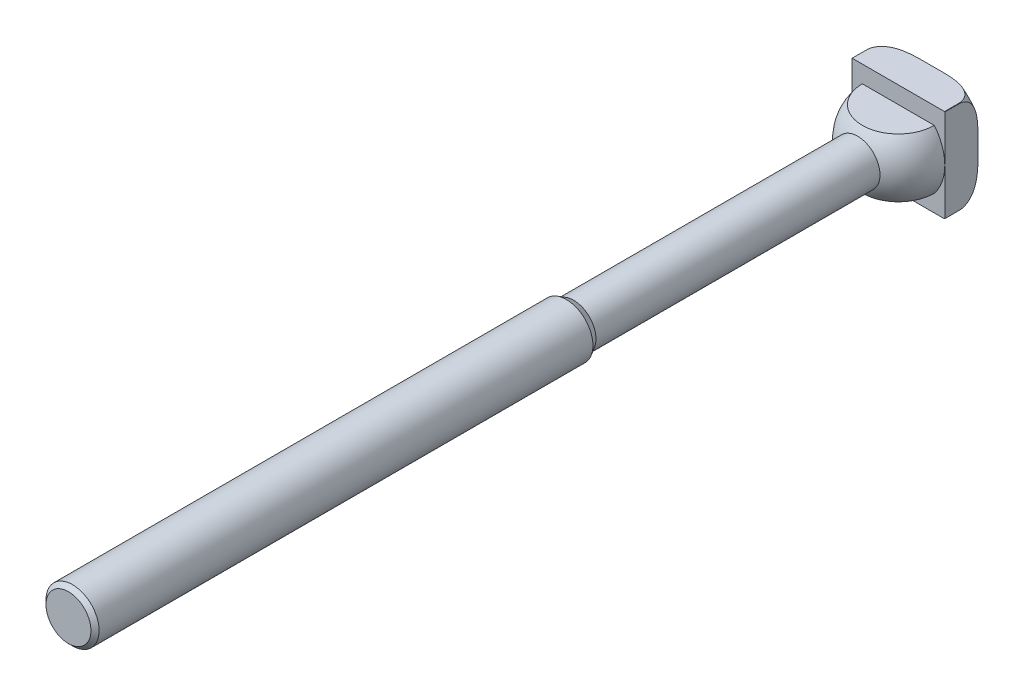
ISO-10303-21;
HEADER;
FILE_DESCRIPTION(('STEP AP214'),'2;1');
FILE_NAME('part.step','',(''),(''),'','','');
FILE_SCHEMA(('AUTOMOTIVE_DESIGN { 1 0 10303 214 1 1 1 1 }'));
ENDSEC;
DATA;
#1=APPLICATION_CONTEXT('core data for automotive mechanical design processes');
#2=APPLICATION_PROTOCOL_DEFINITION('international standard','automotive_design',2000,#1);
#3=PRODUCT_CONTEXT('',#1,'mechanical');
#4=PRODUCT('Part','Part','',(#3));
#5=PRODUCT_RELATED_PRODUCT_CATEGORY('part','',(#4));
#6=PRODUCT_DEFINITION_FORMATION('','',#4);
#7=PRODUCT_DEFINITION_CONTEXT('part definition',#1,'design');
#8=PRODUCT_DEFINITION('design','',#6,#7);
#9=PRODUCT_DEFINITION_SHAPE('','',#8);
#10=(LENGTH_UNIT() NAMED_UNIT(*) SI_UNIT(.MILLI.,.METRE.));
#11=(NAMED_UNIT(*) PLANE_ANGLE_UNIT() SI_UNIT($,.RADIAN.));
#12=(NAMED_UNIT(*) SI_UNIT($,.STERADIAN.) SOLID_ANGLE_UNIT());
#13=UNCERTAINTY_MEASURE_WITH_UNIT(LENGTH_MEASURE(1.E-05),#10,'distance_accuracy_value','');
#14=(GEOMETRIC_REPRESENTATION_CONTEXT(3) GLOBAL_UNCERTAINTY_ASSIGNED_CONTEXT((#13)) GLOBAL_UNIT_ASSIGNED_CONTEXT((#10,
#11,#12)) REPRESENTATION_CONTEXT('',''));
#15=CARTESIAN_POINT('',(0.,0.,0.));
#16=DIRECTION('',(0.,0.,1.));
#17=DIRECTION('',(1.,0.,0.));
#18=AXIS2_PLACEMENT_3D('',#15,#16,#17);
#19=CARTESIAN_POINT('',(0.,0.,-4.4));
#20=DIRECTION('',(0.,0.,1.));
#21=DIRECTION('',(0.,1.,0.));
#22=AXIS2_PLACEMENT_3D('',#19,#20,#21);
#23=TOROIDAL_SURFACE('',#22,14.14,5.6);
#24=CARTESIAN_POINT('',(-14.,0.,-9.99824972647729));
#25=CARTESIAN_POINT('',(-14.,-0.310759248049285,-9.99825085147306));
#26=CARTESIAN_POINT('',(-14.,-0.621518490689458,-9.99853784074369));
#27=CARTESIAN_POINT('',(-14.,-1.24303661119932,-9.99934060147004));
#28=CARTESIAN_POINT('',(-14.,-1.55379548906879,-9.99985637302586));
#29=CARTESIAN_POINT('',(-14.,-2.17555675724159,-10.0000957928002));
#30=CARTESIAN_POINT('',(-14.,-2.48655914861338,-9.99981882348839));
#31=CARTESIAN_POINT('',(-14.,-3.10856376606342,-9.99683999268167));
#32=CARTESIAN_POINT('',(-14.,-3.41956599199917,-9.99413807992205));
#33=CARTESIAN_POINT('',(-14.,-4.04142447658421,-9.98415314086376));
#34=CARTESIAN_POINT('',(-14.,-4.35228075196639,-9.97687135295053));
#35=CARTESIAN_POINT('',(-14.,-4.97375164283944,-9.95513103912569));
#36=CARTESIAN_POINT('',(-14.,-5.28436626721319,-9.94067279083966));
#37=CARTESIAN_POINT('',(-14.,-5.90457312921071,-9.90163480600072));
#38=CARTESIAN_POINT('',(-14.,-6.21416618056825,-9.87706873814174));
#39=CARTESIAN_POINT('',(-14.,-6.83210242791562,-9.8145243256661));
#40=CARTESIAN_POINT('',(-14.,-7.14044538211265,-9.77654350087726));
#41=CARTESIAN_POINT('',(-14.,-7.76037724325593,-9.68271738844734));
#42=CARTESIAN_POINT('',(-14.,-8.07191904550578,-9.62655135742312));
#43=CARTESIAN_POINT('',(-14.,-8.69023154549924,-9.49254678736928));
#44=CARTESIAN_POINT('',(-14.,-8.99700487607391,-9.41472069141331));
#45=CARTESIAN_POINT('',(-14.,-9.60149117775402,-9.23352582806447));
#46=CARTESIAN_POINT('',(-14.,-9.89923995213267,-9.13027881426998));
#47=CARTESIAN_POINT('',(-14.,-10.4824504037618,-8.89388231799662));
#48=CARTESIAN_POINT('',(-14.,-10.7679262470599,-8.76076847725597));
#49=CARTESIAN_POINT('',(-14.,-11.3136573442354,-8.46441782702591));
#50=CARTESIAN_POINT('',(-14.,-11.5743689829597,-8.30203188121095));
#51=CARTESIAN_POINT('',(-14.,-12.0709995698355,-7.94177662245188));
#52=CARTESIAN_POINT('',(-14.,-12.3068984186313,-7.74387888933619));
#53=CARTESIAN_POINT('',(-14.,-12.63518165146,-7.4188785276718));
#54=CARTESIAN_POINT('',(-14.,-12.7408989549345,-7.30509090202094));
#55=CARTESIAN_POINT('',(-14.,-12.9416863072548,-7.06851889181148));
#56=CARTESIAN_POINT('',(-14.,-13.0367621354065,-6.94573945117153));
#57=CARTESIAN_POINT('',(-14.,-13.2145748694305,-6.6917702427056));
#58=CARTESIAN_POINT('',(-14.,-13.2973291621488,-6.56059270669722));
#59=CARTESIAN_POINT('',(-14.,-13.4490161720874,-6.2905462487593));
#60=CARTESIAN_POINT('',(-14.,-13.5179540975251,-6.15168025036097));
#61=CARTESIAN_POINT('',(-14.,-13.6697783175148,-5.79932831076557));
#62=CARTESIAN_POINT('',(-14.,-13.7436357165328,-5.58184122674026));
#63=CARTESIAN_POINT('',(-14.,-13.8537149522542,-5.13762264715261));
#64=CARTESIAN_POINT('',(-14.,-13.8899558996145,-4.91089590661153));
#65=CARTESIAN_POINT('',(-14.,-13.9227119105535,-4.45413617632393));
#66=CARTESIAN_POINT('',(-14.,-13.9191559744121,-4.22409800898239));
#67=CARTESIAN_POINT('',(-14.,-13.8723552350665,-3.76811077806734));
#68=CARTESIAN_POINT('',(-14.,-13.8291052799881,-3.54216224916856));
#69=CARTESIAN_POINT('',(-14.,-13.7070151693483,-3.10597064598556));
#70=CARTESIAN_POINT('',(-14.,-13.6290387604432,-2.89548280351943));
#71=CARTESIAN_POINT('',(-14.,-13.4418093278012,-2.48903531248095));
#72=CARTESIAN_POINT('',(-14.,-13.3325526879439,-2.29307734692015));
#73=CARTESIAN_POINT('',(-14.,-13.0760306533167,-1.90105488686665));
#74=CARTESIAN_POINT('',(-14.,-12.9261604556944,-1.70670634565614));
#75=CARTESIAN_POINT('',(-14.,-12.6009114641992,-1.34062905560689));
#76=CARTESIAN_POINT('',(-14.,-12.425510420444,-1.16892028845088));
#77=CARTESIAN_POINT('',(-14.,-12.0933369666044,-0.881603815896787));
#78=CARTESIAN_POINT('',(-14.,-11.9401944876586,-0.76173253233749));
#79=CARTESIAN_POINT('',(-14.,-11.6238593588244,-0.535952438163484));
#80=CARTESIAN_POINT('',(-14.,-11.4606616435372,-0.430050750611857));
#81=CARTESIAN_POINT('',(-14.,-11.1262197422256,-0.231514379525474));
#82=CARTESIAN_POINT('',(-14.,-10.9549677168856,-0.138892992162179));
#83=CARTESIAN_POINT('',(-14.,-10.6063402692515,0.0338060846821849));
#84=CARTESIAN_POINT('',(-14.,-10.428965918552,0.113885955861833));
#85=CARTESIAN_POINT('',(-14.,-9.95291874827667,0.3106674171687));
#86=CARTESIAN_POINT('',(-14.,-9.65013791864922,0.41746585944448));
#87=CARTESIAN_POINT('',(-14.,-9.03638107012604,0.604202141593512));
#88=CARTESIAN_POINT('',(-14.,-8.72539881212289,0.684118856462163));
#89=CARTESIAN_POINT('',(-14.,-8.09734857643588,0.821773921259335));
#90=CARTESIAN_POINT('',(-14.,-7.78026113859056,0.879421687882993));
#91=CARTESIAN_POINT('',(-14.,-7.14352292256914,0.976351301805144));
#92=CARTESIAN_POINT('',(-14.,-6.82387330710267,1.01564104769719));
#93=CARTESIAN_POINT('',(-14.,-6.08602362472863,1.08964790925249));
#94=CARTESIAN_POINT('',(-14.,-5.66733893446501,1.1193635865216));
#95=CARTESIAN_POINT('',(-14.,-4.82908628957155,1.16245287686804));
#96=CARTESIAN_POINT('',(-14.,-4.40951805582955,1.17582016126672));
#97=CARTESIAN_POINT('',(-14.,-3.56968565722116,1.19303029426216));
#98=CARTESIAN_POINT('',(-14.,-3.14942129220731,1.19686084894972));
#99=CARTESIAN_POINT('',(-14.,-2.30895829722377,1.20041358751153));
#100=CARTESIAN_POINT('',(-14.,-1.88875966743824,1.20013642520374));
#101=CARTESIAN_POINT('',(-14.,-1.04864396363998,1.19915092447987));
#102=CARTESIAN_POINT('',(-14.,-0.628726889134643,1.19844287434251));
#103=CARTESIAN_POINT('',(-14.,0.21112726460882,1.19813401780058));
#104=CARTESIAN_POINT('',(-14.,0.631064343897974,1.19853326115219));
#105=CARTESIAN_POINT('',(-14.,1.47068212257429,1.19965885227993));
#106=CARTESIAN_POINT('',(-14.,1.89036282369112,1.20038500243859));
#107=CARTESIAN_POINT('',(-14.,2.72971643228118,1.19918094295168));
#108=CARTESIAN_POINT('',(-14.,3.14938933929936,1.19725084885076));
#109=CARTESIAN_POINT('',(-14.,3.72184106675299,1.18945550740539));
#110=CARTESIAN_POINT('',(-14.,3.87466005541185,1.18687249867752));
#111=CARTESIAN_POINT('',(-14.,4.18027065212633,1.18040049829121));
#112=CARTESIAN_POINT('',(-14.,4.33306226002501,1.17651149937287));
#113=CARTESIAN_POINT('',(-14.,4.79139482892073,1.16242966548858));
#114=CARTESIAN_POINT('',(-14.,5.09687074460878,1.14982221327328));
#115=CARTESIAN_POINT('',(-14.,5.70773033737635,1.11539646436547));
#116=CARTESIAN_POINT('',(-14.,6.01311337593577,1.0935661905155));
#117=CARTESIAN_POINT('',(-14.,6.62278129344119,1.03760824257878));
#118=CARTESIAN_POINT('',(-14.,6.92706622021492,1.0034811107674));
#119=CARTESIAN_POINT('',(-14.,7.53756680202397,0.919002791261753));
#120=CARTESIAN_POINT('',(-14.,7.84375430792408,0.868441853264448));
#121=CARTESIAN_POINT('',(-14.,8.45235679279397,0.747440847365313));
#122=CARTESIAN_POINT('',(-14.,8.75477072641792,0.676995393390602));
#123=CARTESIAN_POINT('',(-14.,9.35221826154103,0.512485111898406));
#124=CARTESIAN_POINT('',(-14.,9.64727195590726,0.418494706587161));
#125=CARTESIAN_POINT('',(-14.,10.2269376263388,0.202797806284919));
#126=CARTESIAN_POINT('',(-14.,10.5115593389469,0.0811179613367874));
#127=CARTESIAN_POINT('',(-14.,11.073245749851,-0.197865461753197));
#128=CARTESIAN_POINT('',(-14.,11.3498592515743,-0.356091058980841));
#129=CARTESIAN_POINT('',(-14.,11.8788610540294,-0.709917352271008));
#130=CARTESIAN_POINT('',(-14.,12.1312420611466,-0.905529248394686));
#131=CARTESIAN_POINT('',(-14.,12.4845698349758,-1.22925474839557));
#132=CARTESIAN_POINT('',(-14.,12.5987850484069,-1.34304039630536));
#133=CARTESIAN_POINT('',(-14.,12.8164661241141,-1.58042428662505));
#134=CARTESIAN_POINT('',(-14.,12.9199380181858,-1.70401695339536));
#135=CARTESIAN_POINT('',(-14.,13.1142800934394,-1.9605135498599));
#136=CARTESIAN_POINT('',(-14.,13.205167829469,-2.09340411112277));
#137=CARTESIAN_POINT('',(-14.,13.372664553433,-2.36782024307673));
#138=CARTESIAN_POINT('',(-14.,13.4492796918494,-2.50934205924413));
#139=CARTESIAN_POINT('',(-14.,13.6163411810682,-2.86319975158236));
#140=CARTESIAN_POINT('',(-14.,13.6983634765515,-3.07961651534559));
#141=CARTESIAN_POINT('',(-14.,13.824923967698,-3.52306568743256));
#142=CARTESIAN_POINT('',(-14.,13.8694841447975,-3.75009178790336));
#143=CARTESIAN_POINT('',(-14.,13.9185610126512,-4.2090333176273));
#144=CARTESIAN_POINT('',(-14.,13.9229835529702,-4.44095896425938));
#145=CARTESIAN_POINT('',(-14.,13.8912351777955,-4.90200336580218));
#146=CARTESIAN_POINT('',(-14.,13.8550611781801,-5.13112190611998));
#147=CARTESIAN_POINT('',(-14.,13.7462858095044,-5.5721594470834));
#148=CARTESIAN_POINT('',(-14.,13.6749635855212,-5.78439832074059));
#149=CARTESIAN_POINT('',(-14.,13.5003447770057,-6.19518406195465));
#150=CARTESIAN_POINT('',(-14.,13.3970432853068,-6.39372882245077));
#151=CARTESIAN_POINT('',(-14.,13.1534590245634,-6.78957755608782));
#152=CARTESIAN_POINT('',(-14.,13.0108272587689,-6.98542587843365));
#153=CARTESIAN_POINT('',(-14.,12.6995996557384,-7.35524295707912));
#154=CARTESIAN_POINT('',(-14.,12.5309874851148,-7.52919782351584));
#155=CARTESIAN_POINT('',(-14.,12.2128466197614,-7.81886907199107));
#156=CARTESIAN_POINT('',(-14.,12.0672621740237,-7.93898454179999));
#157=CARTESIAN_POINT('',(-14.,11.7660321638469,-8.16591189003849));
#158=CARTESIAN_POINT('',(-14.,11.6103820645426,-8.272717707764));
#159=CARTESIAN_POINT('',(-14.,11.1309674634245,-8.57419374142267));
#160=CARTESIAN_POINT('',(-14.,10.7950194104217,-8.74967609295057));
#161=CARTESIAN_POINT('',(-14.,10.1706537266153,-9.02589055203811));
#162=CARTESIAN_POINT('',(-14.,9.88556746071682,-9.13451214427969));
#163=CARTESIAN_POINT('',(-14.,9.30681398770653,-9.32642336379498));
#164=CARTESIAN_POINT('',(-14.,9.01314069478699,-9.40969452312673));
#165=CARTESIAN_POINT('',(-14.,8.42011381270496,-9.55475710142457));
#166=CARTESIAN_POINT('',(-14.,8.12075104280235,-9.61651002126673));
#167=CARTESIAN_POINT('',(-14.,7.51883351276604,-9.72211873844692));
#168=CARTESIAN_POINT('',(-14.,7.21627753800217,-9.76596745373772));
#169=CARTESIAN_POINT('',(-14.,6.6268227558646,-9.83715592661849));
#170=CARTESIAN_POINT('',(-14.,6.34001723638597,-9.86529590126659));
#171=CARTESIAN_POINT('',(-14.,5.76566600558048,-9.91149411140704));
#172=CARTESIAN_POINT('',(-14.,5.47812040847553,-9.92955381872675));
#173=CARTESIAN_POINT('',(-14.,4.90241848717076,-9.95811498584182));
#174=CARTESIAN_POINT('',(-14.,4.61426184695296,-9.96860968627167));
#175=CARTESIAN_POINT('',(-14.,4.0378073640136,-9.98427067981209));
#176=CARTESIAN_POINT('',(-14.,3.74950951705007,-9.98943680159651));
#177=CARTESIAN_POINT('',(-14.,3.17268829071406,-9.99640544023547));
#178=CARTESIAN_POINT('',(-14.,2.88416488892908,-9.99820571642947));
#179=CARTESIAN_POINT('',(-14.,2.30711989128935,-10.0000585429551));
#180=CARTESIAN_POINT('',(-14.,2.01859829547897,-10.0001111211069));
#181=CARTESIAN_POINT('',(-14.,1.44173081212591,-9.99968852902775));
#182=CARTESIAN_POINT('',(-14.,1.1533849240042,-9.99921367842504));
#183=CARTESIAN_POINT('',(-14.,0.576692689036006,-9.99849375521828));
#184=CARTESIAN_POINT('',(-14.,0.2883463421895,-9.99824868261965));
#185=CARTESIAN_POINT('',(-14.,0.,-9.99824972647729));
#186=B_SPLINE_CURVE_WITH_KNOTS('',3,(#24,#25,#26,#27,#28,#29,#30,#31,#32,#33,#34,#35,#36,#37,
#38,#39,#40,#41,#42,#43,#44,#45,#46,#47,#48,#49,#50,#51,#52,#53,#54,#55,#56,#57,#58,#59,#60,#61,
#62,#63,#64,#65,#66,#67,#68,#69,#70,#71,#72,#73,#74,#75,#76,#77,#78,#79,#80,#81,#82,#83,#84,#85,
#86,#87,#88,#89,#90,#91,#92,#93,#94,#95,#96,#97,#98,#99,#100,#101,#102,#103,#104,#105,#106,#107,
#108,#109,#110,#111,#112,#113,#114,#115,#116,#117,#118,#119,#120,#121,#122,#123,#124,#125,#126,
#127,#128,#129,#130,#131,#132,#133,#134,#135,#136,#137,#138,#139,#140,#141,#142,#143,#144,#145,
#146,#147,#148,#149,#150,#151,#152,#153,#154,#155,#156,#157,#158,#159,#160,#161,#162,#163,#164,
#165,#166,#167,#168,#169,#170,#171,#172,#173,#174,#175,#176,#177,#178,#179,#180,#181,#182,#183,
#184,#185),.UNSPECIFIED.,.T.,.F.,(4,2,2,2,2,2,2,2,2,2,2,2,2,2,2,2,2,2,2,2,2,2,2,2,2,2,2,2,2,2,2,
2,2,2,2,2,2,2,2,2,2,2,2,2,2,2,2,2,2,2,2,2,2,2,2,2,2,2,2,2,2,2,2,2,2,2,2,2,2,2,2,2,2,2,2,2,2,2,2,
2,4),(0.,0.932277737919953,1.86455588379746,2.79756045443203,3.73058474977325,4.66335686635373,
5.59609290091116,6.52757173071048,7.45922286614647,8.40829357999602,9.35682020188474,
10.3008893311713,11.2438377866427,12.1628389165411,13.0825788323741,13.5480143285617,
14.0131958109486,14.4777145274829,14.9420578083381,15.6278649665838,16.3133235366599,
17.0000051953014,17.6867759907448,18.3573439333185,19.0279894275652,19.7615747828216,
20.4958033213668,21.0784512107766,21.6613950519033,22.2449185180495,22.8283403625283,
23.7898904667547,24.7521944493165,25.7183725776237,26.6841346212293,27.9428211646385,
29.2019948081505,30.4627908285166,31.7233861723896,32.9831390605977,34.2429485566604,
35.5019975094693,36.7609916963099,37.2195087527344,37.6780283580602,38.5951359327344,
39.5134381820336,40.4316999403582,41.3621750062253,42.2929023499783,43.220724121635,
44.1476566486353,45.1011871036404,46.0550036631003,46.5381223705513,47.0209683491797,
47.5031338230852,47.985091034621,48.676179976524,49.3668631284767,50.0591659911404,
50.7515214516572,51.4203582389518,52.089297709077,52.8134628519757,53.5380851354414,
54.1035302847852,54.6692319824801,55.8017422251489,56.7158020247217,57.6305261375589,
58.5468785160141,59.4635930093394,60.3279216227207,61.1921240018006,62.0570975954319,
62.9220989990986,63.7876760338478,64.6532392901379,65.5182782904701,66.3833173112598),.UNSPECIFIED.);
#187=CARTESIAN_POINT('',(-14.,-1.98484256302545,-10.));
#188=VERTEX_POINT('',#187);
#189=CARTESIAN_POINT('',(-14.,-13.916450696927,-4.4));
#190=VERTEX_POINT('',#189);
#191=EDGE_CURVE('E140',#188,#190,#186,.T.);
#192=ORIENTED_EDGE('',*,*,#191,.F.);
#193=CARTESIAN_POINT('',(0.,0.,-10.));
#194=DIRECTION('',(0.,0.,1.));
#195=DIRECTION('',(0.,1.,0.));
#196=AXIS2_PLACEMENT_3D('',#193,#194,#195);
#197=CIRCLE('',#196,14.14);
#198=CARTESIAN_POINT('',(-1.98484256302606,-14.,-10.));
#199=VERTEX_POINT('',#198);
#200=EDGE_CURVE('E239',#188,#199,#197,.T.);
#201=ORIENTED_EDGE('',*,*,#200,.T.);
#202=CARTESIAN_POINT('',(0.,-14.,-9.99824972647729));
#203=CARTESIAN_POINT('',(0.310759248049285,-14.,-9.99825085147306));
#204=CARTESIAN_POINT('',(0.621518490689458,-14.,-9.99853784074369));
#205=CARTESIAN_POINT('',(1.24303661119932,-14.,-9.99934060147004));
#206=CARTESIAN_POINT('',(1.55379548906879,-14.,-9.99985637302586));
#207=CARTESIAN_POINT('',(2.17555675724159,-14.,-10.0000957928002));
#208=CARTESIAN_POINT('',(2.48655914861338,-14.,-9.99981882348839));
#209=CARTESIAN_POINT('',(3.10856376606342,-14.,-9.99683999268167));
#210=CARTESIAN_POINT('',(3.41956599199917,-14.,-9.99413807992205));
#211=CARTESIAN_POINT('',(4.04142447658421,-14.,-9.98415314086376));
#212=CARTESIAN_POINT('',(4.35228075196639,-14.,-9.97687135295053));
#213=CARTESIAN_POINT('',(4.97375164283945,-14.,-9.95513103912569));
#214=CARTESIAN_POINT('',(5.28436626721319,-14.,-9.94067279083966));
#215=CARTESIAN_POINT('',(5.90457312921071,-14.,-9.90163480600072));
#216=CARTESIAN_POINT('',(6.21416618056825,-14.,-9.87706873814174));
#217=CARTESIAN_POINT('',(6.83210242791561,-14.,-9.8145243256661));
#218=CARTESIAN_POINT('',(7.14044538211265,-14.,-9.77654350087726));
#219=CARTESIAN_POINT('',(7.76037724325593,-14.,-9.68271738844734));
#220=CARTESIAN_POINT('',(8.07191904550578,-14.,-9.62655135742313));
#221=CARTESIAN_POINT('',(8.69023154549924,-14.,-9.49254678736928));
#222=CARTESIAN_POINT('',(8.99700487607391,-14.,-9.41472069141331));
#223=CARTESIAN_POINT('',(9.60149117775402,-14.,-9.23352582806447));
#224=CARTESIAN_POINT('',(9.89923995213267,-14.,-9.13027881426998));
#225=CARTESIAN_POINT('',(10.4824504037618,-14.,-8.89388231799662));
#226=CARTESIAN_POINT('',(10.7679262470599,-14.,-8.76076847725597));
#227=CARTESIAN_POINT('',(11.3136573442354,-14.,-8.46441782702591));
#228=CARTESIAN_POINT('',(11.5743689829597,-14.,-8.30203188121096));
#229=CARTESIAN_POINT('',(12.0709995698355,-14.,-7.94177662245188));
#230=CARTESIAN_POINT('',(12.3068984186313,-14.,-7.74387888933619));
#231=CARTESIAN_POINT('',(12.63518165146,-14.,-7.4188785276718));
#232=CARTESIAN_POINT('',(12.7408989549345,-14.,-7.30509090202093));
#233=CARTESIAN_POINT('',(12.9416863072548,-14.,-7.06851889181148));
#234=CARTESIAN_POINT('',(13.0367621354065,-14.,-6.94573945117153));
#235=CARTESIAN_POINT('',(13.2145748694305,-14.,-6.69177024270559));
#236=CARTESIAN_POINT('',(13.2973291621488,-14.,-6.56059270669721));
#237=CARTESIAN_POINT('',(13.4490161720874,-14.,-6.2905462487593));
#238=CARTESIAN_POINT('',(13.5179540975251,-14.,-6.15168025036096));
#239=CARTESIAN_POINT('',(13.6697783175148,-14.,-5.79932831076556));
#240=CARTESIAN_POINT('',(13.7436357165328,-14.,-5.58184122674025));
#241=CARTESIAN_POINT('',(13.8537149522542,-14.,-5.13762264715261));
#242=CARTESIAN_POINT('',(13.8899558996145,-14.,-4.91089590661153));
#243=CARTESIAN_POINT('',(13.9227119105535,-14.,-4.45413617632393));
#244=CARTESIAN_POINT('',(13.9191559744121,-14.,-4.22409800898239));
#245=CARTESIAN_POINT('',(13.8723552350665,-14.,-3.76811077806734));
#246=CARTESIAN_POINT('',(13.8291052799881,-14.,-3.54216224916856));
#247=CARTESIAN_POINT('',(13.7070151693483,-14.,-3.10597064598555));
#248=CARTESIAN_POINT('',(13.6290387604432,-14.,-2.89548280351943));
#249=CARTESIAN_POINT('',(13.4418093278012,-14.,-2.48903531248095));
#250=CARTESIAN_POINT('',(13.3325526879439,-14.,-2.29307734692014));
#251=CARTESIAN_POINT('',(13.0760306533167,-14.,-1.90105488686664));
#252=CARTESIAN_POINT('',(12.9261604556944,-14.,-1.70670634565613));
#253=CARTESIAN_POINT('',(12.6009114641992,-14.,-1.34062905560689));
#254=CARTESIAN_POINT('',(12.425510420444,-14.,-1.16892028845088));
#255=CARTESIAN_POINT('',(12.0933369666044,-14.,-0.881603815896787));
#256=CARTESIAN_POINT('',(11.9401944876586,-14.,-0.76173253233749));
#257=CARTESIAN_POINT('',(11.6238593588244,-14.,-0.535952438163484));
#258=CARTESIAN_POINT('',(11.4606616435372,-14.,-0.430050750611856));
#259=CARTESIAN_POINT('',(11.1262197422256,-14.,-0.231514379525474));
#260=CARTESIAN_POINT('',(10.9549677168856,-14.,-0.138892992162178));
#261=CARTESIAN_POINT('',(10.6063402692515,-14.,0.0338060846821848));
#262=CARTESIAN_POINT('',(10.428965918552,-14.,0.113885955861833));
#263=CARTESIAN_POINT('',(9.95291874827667,-14.,0.3106674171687));
#264=CARTESIAN_POINT('',(9.65013791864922,-14.,0.417465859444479));
#265=CARTESIAN_POINT('',(9.03638107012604,-14.,0.604202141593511));
#266=CARTESIAN_POINT('',(8.72539881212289,-14.,0.684118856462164));
#267=CARTESIAN_POINT('',(8.09734857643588,-14.,0.821773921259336));
#268=CARTESIAN_POINT('',(7.78026113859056,-14.,0.879421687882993));
#269=CARTESIAN_POINT('',(7.14352292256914,-14.,0.976351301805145));
#270=CARTESIAN_POINT('',(6.82387330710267,-14.,1.01564104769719));
#271=CARTESIAN_POINT('',(6.08602362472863,-14.,1.08964790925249));
#272=CARTESIAN_POINT('',(5.66733893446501,-14.,1.1193635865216));
#273=CARTESIAN_POINT('',(4.82908628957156,-14.,1.16245287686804));
#274=CARTESIAN_POINT('',(4.40951805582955,-14.,1.17582016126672));
#275=CARTESIAN_POINT('',(3.56968565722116,-14.,1.19303029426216));
#276=CARTESIAN_POINT('',(3.14942129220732,-14.,1.19686084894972));
#277=CARTESIAN_POINT('',(2.30895829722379,-14.,1.20041358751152));
#278=CARTESIAN_POINT('',(1.88875966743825,-14.,1.20013642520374));
#279=CARTESIAN_POINT('',(1.04864396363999,-14.,1.19915092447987));
#280=CARTESIAN_POINT('',(0.628726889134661,-14.,1.19844287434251));
#281=CARTESIAN_POINT('',(-0.211127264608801,-14.,1.19813401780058));
#282=CARTESIAN_POINT('',(-0.631064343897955,-14.,1.19853326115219));
#283=CARTESIAN_POINT('',(-1.47068212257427,-14.,1.19965885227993));
#284=CARTESIAN_POINT('',(-1.89036282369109,-14.,1.20038500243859));
#285=CARTESIAN_POINT('',(-2.72971643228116,-14.,1.19918094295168));
#286=CARTESIAN_POINT('',(-3.14938933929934,-14.,1.19725084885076));
#287=CARTESIAN_POINT('',(-3.72184106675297,-14.,1.18945550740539));
#288=CARTESIAN_POINT('',(-3.87466005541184,-14.,1.18687249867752));
#289=CARTESIAN_POINT('',(-4.18027065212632,-14.,1.18040049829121));
#290=CARTESIAN_POINT('',(-4.333062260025,-14.,1.17651149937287));
#291=CARTESIAN_POINT('',(-4.79139482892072,-14.,1.16242966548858));
#292=CARTESIAN_POINT('',(-5.09687074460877,-14.,1.14982221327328));
#293=CARTESIAN_POINT('',(-5.70773033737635,-14.,1.11539646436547));
#294=CARTESIAN_POINT('',(-6.01311337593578,-14.,1.0935661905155));
#295=CARTESIAN_POINT('',(-6.62278129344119,-14.,1.03760824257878));
#296=CARTESIAN_POINT('',(-6.92706622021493,-14.,1.0034811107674));
#297=CARTESIAN_POINT('',(-7.53756680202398,-14.,0.919002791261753));
#298=CARTESIAN_POINT('',(-7.8437543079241,-14.,0.868441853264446));
#299=CARTESIAN_POINT('',(-8.45235679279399,-14.,0.747440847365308));
#300=CARTESIAN_POINT('',(-8.75477072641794,-14.,0.676995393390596));
#301=CARTESIAN_POINT('',(-9.35221826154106,-14.,0.512485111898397));
#302=CARTESIAN_POINT('',(-9.64727195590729,-14.,0.41849470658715));
#303=CARTESIAN_POINT('',(-10.2269376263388,-14.,0.202797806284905));
#304=CARTESIAN_POINT('',(-10.5115593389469,-14.,0.081117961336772));
#305=CARTESIAN_POINT('',(-11.0732457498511,-14.,-0.197865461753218));
#306=CARTESIAN_POINT('',(-11.3498592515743,-14.,-0.356091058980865));
#307=CARTESIAN_POINT('',(-11.8788610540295,-14.,-0.709917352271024));
#308=CARTESIAN_POINT('',(-12.1312420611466,-14.,-0.905529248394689));
#309=CARTESIAN_POINT('',(-12.4845698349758,-14.,-1.22925474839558));
#310=CARTESIAN_POINT('',(-12.5987850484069,-14.,-1.34304039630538));
#311=CARTESIAN_POINT('',(-12.8164661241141,-14.,-1.58042428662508));
#312=CARTESIAN_POINT('',(-12.9199380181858,-14.,-1.70401695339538));
#313=CARTESIAN_POINT('',(-13.1142800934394,-14.,-1.96051354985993));
#314=CARTESIAN_POINT('',(-13.205167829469,-14.,-2.09340411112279));
#315=CARTESIAN_POINT('',(-13.372664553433,-14.,-2.36782024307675));
#316=CARTESIAN_POINT('',(-13.4492796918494,-14.,-2.50934205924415));
#317=CARTESIAN_POINT('',(-13.6163411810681,-14.,-2.86319975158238));
#318=CARTESIAN_POINT('',(-13.6983634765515,-14.,-3.07961651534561));
#319=CARTESIAN_POINT('',(-13.824923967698,-14.,-3.52306568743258));
#320=CARTESIAN_POINT('',(-13.8694841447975,-14.,-3.75009178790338));
#321=CARTESIAN_POINT('',(-13.9185610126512,-14.,-4.20903331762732));
#322=CARTESIAN_POINT('',(-13.9229835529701,-14.,-4.4409589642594));
#323=CARTESIAN_POINT('',(-13.8912351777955,-14.,-4.9020033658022));
#324=CARTESIAN_POINT('',(-13.8550611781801,-14.,-5.13112190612));
#325=CARTESIAN_POINT('',(-13.7462858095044,-14.,-5.57215944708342));
#326=CARTESIAN_POINT('',(-13.6749635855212,-14.,-5.78439832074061));
#327=CARTESIAN_POINT('',(-13.5003447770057,-14.,-6.19518406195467));
#328=CARTESIAN_POINT('',(-13.3970432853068,-14.,-6.39372882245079));
#329=CARTESIAN_POINT('',(-13.1534590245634,-14.,-6.78957755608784));
#330=CARTESIAN_POINT('',(-13.0108272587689,-14.,-6.98542587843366));
#331=CARTESIAN_POINT('',(-12.6995996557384,-14.,-7.35524295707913));
#332=CARTESIAN_POINT('',(-12.5309874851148,-14.,-7.52919782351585));
#333=CARTESIAN_POINT('',(-12.2128466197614,-14.,-7.81886907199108));
#334=CARTESIAN_POINT('',(-12.0672621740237,-14.,-7.93898454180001));
#335=CARTESIAN_POINT('',(-11.7660321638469,-14.,-8.16591189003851));
#336=CARTESIAN_POINT('',(-11.6103820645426,-14.,-8.27271770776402));
#337=CARTESIAN_POINT('',(-11.1309674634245,-14.,-8.57419374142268));
#338=CARTESIAN_POINT('',(-10.7950194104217,-14.,-8.74967609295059));
#339=CARTESIAN_POINT('',(-10.1706537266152,-14.,-9.02589055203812));
#340=CARTESIAN_POINT('',(-9.88556746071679,-14.,-9.1345121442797));
#341=CARTESIAN_POINT('',(-9.3068139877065,-14.,-9.32642336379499));
#342=CARTESIAN_POINT('',(-9.01314069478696,-14.,-9.40969452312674));
#343=CARTESIAN_POINT('',(-8.42011381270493,-14.,-9.55475710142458));
#344=CARTESIAN_POINT('',(-8.12075104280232,-14.,-9.61651002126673));
#345=CARTESIAN_POINT('',(-7.518833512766,-14.,-9.72211873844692));
#346=CARTESIAN_POINT('',(-7.21627753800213,-14.,-9.76596745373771));
#347=CARTESIAN_POINT('',(-6.62682275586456,-14.,-9.83715592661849));
#348=CARTESIAN_POINT('',(-6.34001723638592,-14.,-9.86529590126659));
#349=CARTESIAN_POINT('',(-5.76566600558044,-14.,-9.91149411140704));
#350=CARTESIAN_POINT('',(-5.4781204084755,-14.,-9.92955381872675));
#351=CARTESIAN_POINT('',(-4.90241848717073,-14.,-9.95811498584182));
#352=CARTESIAN_POINT('',(-4.61426184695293,-14.,-9.96860968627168));
#353=CARTESIAN_POINT('',(-4.03780736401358,-14.,-9.98427067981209));
#354=CARTESIAN_POINT('',(-3.74950951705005,-14.,-9.98943680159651));
#355=CARTESIAN_POINT('',(-3.17268829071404,-14.,-9.99640544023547));
#356=CARTESIAN_POINT('',(-2.88416488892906,-14.,-9.99820571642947));
#357=CARTESIAN_POINT('',(-2.30711989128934,-14.,-10.0000585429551));
#358=CARTESIAN_POINT('',(-2.01859829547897,-14.,-10.0001111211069));
#359=CARTESIAN_POINT('',(-1.4417308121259,-14.,-9.99968852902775));
#360=CARTESIAN_POINT('',(-1.1533849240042,-14.,-9.99921367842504));
#361=CARTESIAN_POINT('',(-0.576692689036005,-14.,-9.99849375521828));
#362=CARTESIAN_POINT('',(-0.2883463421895,-14.,-9.99824868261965));
#363=CARTESIAN_POINT('',(0.,-14.,-9.99824972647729));
#364=B_SPLINE_CURVE_WITH_KNOTS('',3,(#202,#203,#204,#205,#206,#207,#208,#209,#210,#211,#212,
#213,#214,#215,#216,#217,#218,#219,#220,#221,#222,#223,#224,#225,#226,#227,#228,#229,#230,#231,
#232,#233,#234,#235,#236,#237,#238,#239,#240,#241,#242,#243,#244,#245,#246,#247,#248,#249,#250,
#251,#252,#253,#254,#255,#256,#257,#258,#259,#260,#261,#262,#263,#264,#265,#266,#267,#268,#269,
#270,#271,#272,#273,#274,#275,#276,#277,#278,#279,#280,#281,#282,#283,#284,#285,#286,#287,#288,
#289,#290,#291,#292,#293,#294,#295,#296,#297,#298,#299,#300,#301,#302,#303,#304,#305,#306,#307,
#308,#309,#310,#311,#312,#313,#314,#315,#316,#317,#318,#319,#320,#321,#322,#323,#324,#325,#326,
#327,#328,#329,#330,#331,#332,#333,#334,#335,#336,#337,#338,#339,#340,#341,#342,#343,#344,#345,
#346,#347,#348,#349,#350,#351,#352,#353,#354,#355,#356,#357,#358,#359,#360,#361,#362,#363),
.UNSPECIFIED.,.T.,.F.,(4,2,2,2,2,2,2,2,2,2,2,2,2,2,2,2,2,2,2,2,2,2,2,2,2,2,2,2,2,2,2,2,2,2,2,2,
2,2,2,2,2,2,2,2,2,2,2,2,2,2,2,2,2,2,2,2,2,2,2,2,2,2,2,2,2,2,2,2,2,2,2,2,2,2,2,2,2,2,2,2,4),(0.,
0.932277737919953,1.86455588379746,2.79756045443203,3.73058474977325,4.66335686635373,
5.59609290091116,6.52757173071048,7.45922286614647,8.40829357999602,9.35682020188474,
10.3008893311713,11.2438377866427,12.1628389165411,13.0825788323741,13.5480143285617,
14.0131958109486,14.4777145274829,14.9420578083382,15.6278649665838,16.3133235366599,
17.0000051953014,17.6867759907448,18.3573439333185,19.0279894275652,19.7615747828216,
20.4958033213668,21.0784512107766,21.6613950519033,22.2449185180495,22.8283403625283,
23.7898904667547,24.7521944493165,25.7183725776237,26.6841346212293,27.9428211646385,
29.2019948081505,30.4627908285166,31.7233861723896,32.9831390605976,34.2429485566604,
35.5019975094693,36.7609916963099,37.2195087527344,37.6780283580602,38.5951359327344,
39.5134381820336,40.4316999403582,41.3621750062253,42.2929023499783,43.220724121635,
44.1476566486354,45.1011871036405,46.0550036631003,46.5381223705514,47.0209683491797,
47.5031338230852,47.9850910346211,48.676179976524,49.3668631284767,50.0591659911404,
50.7515214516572,51.4203582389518,52.089297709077,52.8134628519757,53.5380851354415,
54.1035302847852,54.6692319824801,55.8017422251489,56.7158020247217,57.6305261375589,
58.5468785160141,59.4635930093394,60.3279216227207,61.1921240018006,62.0570975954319,
62.9220989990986,63.7876760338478,64.6532392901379,65.5182782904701,66.3833173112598),.UNSPECIFIED.);
#365=CARTESIAN_POINT('',(-13.916450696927,-14.,-4.4));
#366=VERTEX_POINT('',#365);
#367=EDGE_CURVE('E177',#366,#199,#364,.T.);
#368=ORIENTED_EDGE('',*,*,#367,.F.);
#369=CARTESIAN_POINT('',(0.,0.,-4.4));
#370=DIRECTION('',(0.,0.,1.));
#371=DIRECTION('',(0.,1.,0.));
#372=AXIS2_PLACEMENT_3D('',#369,#370,#371);
#373=CIRCLE('',#372,19.74);
#374=EDGE_CURVE('E174',#190,#366,#373,.T.);
#375=ORIENTED_EDGE('',*,*,#374,.F.);
#376=EDGE_LOOP('',(#192,#201,#368,#375));
#377=FACE_BOUND('',#376,.T.);
#378=ADVANCED_FACE('F14',(#377),#23,.T.);
#379=CARTESIAN_POINT('',(1.98484256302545,-14.,-10.));
#380=VERTEX_POINT('',#379);
#381=CARTESIAN_POINT('',(13.916450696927,-14.,-4.4));
#382=VERTEX_POINT('',#381);
#383=EDGE_CURVE('E180',#380,#382,#364,.T.);
#384=ORIENTED_EDGE('',*,*,#383,.F.);
#385=CARTESIAN_POINT('',(14.,-1.98484256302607,-10.));
#386=VERTEX_POINT('',#385);
#387=EDGE_CURVE('E338',#380,#386,#197,.T.);
#388=ORIENTED_EDGE('',*,*,#387,.T.);
#389=CARTESIAN_POINT('',(14.,0.,-9.99824972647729));
#390=CARTESIAN_POINT('',(14.,0.310759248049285,-9.99825085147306));
#391=CARTESIAN_POINT('',(14.,0.621518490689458,-9.99853784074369));
#392=CARTESIAN_POINT('',(14.,1.24303661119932,-9.99934060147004));
#393=CARTESIAN_POINT('',(14.,1.55379548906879,-9.99985637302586));
#394=CARTESIAN_POINT('',(14.,2.17555675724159,-10.0000957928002));
#395=CARTESIAN_POINT('',(14.,2.48655914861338,-9.99981882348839));
#396=CARTESIAN_POINT('',(14.,3.10856376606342,-9.99683999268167));
#397=CARTESIAN_POINT('',(14.,3.41956599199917,-9.99413807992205));
#398=CARTESIAN_POINT('',(14.,4.04142447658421,-9.98415314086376));
#399=CARTESIAN_POINT('',(14.,4.35228075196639,-9.97687135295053));
#400=CARTESIAN_POINT('',(14.,4.97375164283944,-9.95513103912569));
#401=CARTESIAN_POINT('',(14.,5.28436626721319,-9.94067279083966));
#402=CARTESIAN_POINT('',(14.,5.90457312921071,-9.90163480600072));
#403=CARTESIAN_POINT('',(14.,6.21416618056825,-9.87706873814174));
#404=CARTESIAN_POINT('',(14.,6.83210242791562,-9.8145243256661));
#405=CARTESIAN_POINT('',(14.,7.14044538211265,-9.77654350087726));
#406=CARTESIAN_POINT('',(14.,7.76037724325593,-9.68271738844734));
#407=CARTESIAN_POINT('',(14.,8.07191904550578,-9.62655135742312));
#408=CARTESIAN_POINT('',(14.,8.69023154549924,-9.49254678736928));
#409=CARTESIAN_POINT('',(14.,8.99700487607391,-9.41472069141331));
#410=CARTESIAN_POINT('',(14.,9.60149117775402,-9.23352582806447));
#411=CARTESIAN_POINT('',(14.,9.89923995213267,-9.13027881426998));
#412=CARTESIAN_POINT('',(14.,10.4824504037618,-8.89388231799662));
#413=CARTESIAN_POINT('',(14.,10.7679262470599,-8.76076847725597));
#414=CARTESIAN_POINT('',(14.,11.3136573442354,-8.46441782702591));
#415=CARTESIAN_POINT('',(14.,11.5743689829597,-8.30203188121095));
#416=CARTESIAN_POINT('',(14.,12.0709995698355,-7.94177662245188));
#417=CARTESIAN_POINT('',(14.,12.3068984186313,-7.74387888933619));
#418=CARTESIAN_POINT('',(14.,12.63518165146,-7.4188785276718));
#419=CARTESIAN_POINT('',(14.,12.7408989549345,-7.30509090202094));
#420=CARTESIAN_POINT('',(14.,12.9416863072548,-7.06851889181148));
#421=CARTESIAN_POINT('',(14.,13.0367621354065,-6.94573945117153));
#422=CARTESIAN_POINT('',(14.,13.2145748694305,-6.6917702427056));
#423=CARTESIAN_POINT('',(14.,13.2973291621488,-6.56059270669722));
#424=CARTESIAN_POINT('',(14.,13.4490161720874,-6.2905462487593));
#425=CARTESIAN_POINT('',(14.,13.5179540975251,-6.15168025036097));
#426=CARTESIAN_POINT('',(14.,13.6697783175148,-5.79932831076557));
#427=CARTESIAN_POINT('',(14.,13.7436357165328,-5.58184122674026));
#428=CARTESIAN_POINT('',(14.,13.8537149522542,-5.13762264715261));
#429=CARTESIAN_POINT('',(14.,13.8899558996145,-4.91089590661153));
#430=CARTESIAN_POINT('',(14.,13.9227119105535,-4.45413617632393));
#431=CARTESIAN_POINT('',(14.,13.9191559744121,-4.22409800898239));
#432=CARTESIAN_POINT('',(14.,13.8723552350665,-3.76811077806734));
#433=CARTESIAN_POINT('',(14.,13.8291052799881,-3.54216224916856));
#434=CARTESIAN_POINT('',(14.,13.7070151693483,-3.10597064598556));
#435=CARTESIAN_POINT('',(14.,13.6290387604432,-2.89548280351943));
#436=CARTESIAN_POINT('',(14.,13.4418093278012,-2.48903531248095));
#437=CARTESIAN_POINT('',(14.,13.3325526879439,-2.29307734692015));
#438=CARTESIAN_POINT('',(14.,13.0760306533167,-1.90105488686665));
#439=CARTESIAN_POINT('',(14.,12.9261604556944,-1.70670634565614));
#440=CARTESIAN_POINT('',(14.,12.6009114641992,-1.34062905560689));
#441=CARTESIAN_POINT('',(14.,12.425510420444,-1.16892028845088));
#442=CARTESIAN_POINT('',(14.,12.0933369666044,-0.881603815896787));
#443=CARTESIAN_POINT('',(14.,11.9401944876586,-0.76173253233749));
#444=CARTESIAN_POINT('',(14.,11.6238593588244,-0.535952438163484));
#445=CARTESIAN_POINT('',(14.,11.4606616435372,-0.430050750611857));
#446=CARTESIAN_POINT('',(14.,11.1262197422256,-0.231514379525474));
#447=CARTESIAN_POINT('',(14.,10.9549677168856,-0.138892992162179));
#448=CARTESIAN_POINT('',(14.,10.6063402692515,0.0338060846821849));
#449=CARTESIAN_POINT('',(14.,10.428965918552,0.113885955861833));
#450=CARTESIAN_POINT('',(14.,9.95291874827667,0.3106674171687));
#451=CARTESIAN_POINT('',(14.,9.65013791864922,0.41746585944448));
#452=CARTESIAN_POINT('',(14.,9.03638107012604,0.604202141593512));
#453=CARTESIAN_POINT('',(14.,8.72539881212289,0.684118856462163));
#454=CARTESIAN_POINT('',(14.,8.09734857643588,0.821773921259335));
#455=CARTESIAN_POINT('',(14.,7.78026113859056,0.879421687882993));
#456=CARTESIAN_POINT('',(14.,7.14352292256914,0.976351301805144));
#457=CARTESIAN_POINT('',(14.,6.82387330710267,1.01564104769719));
#458=CARTESIAN_POINT('',(14.,6.08602362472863,1.08964790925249));
#459=CARTESIAN_POINT('',(14.,5.66733893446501,1.1193635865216));
#460=CARTESIAN_POINT('',(14.,4.82908628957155,1.16245287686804));
#461=CARTESIAN_POINT('',(14.,4.40951805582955,1.17582016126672));
#462=CARTESIAN_POINT('',(14.,3.56968565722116,1.19303029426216));
#463=CARTESIAN_POINT('',(14.,3.14942129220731,1.19686084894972));
#464=CARTESIAN_POINT('',(14.,2.30895829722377,1.20041358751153));
#465=CARTESIAN_POINT('',(14.,1.88875966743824,1.20013642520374));
#466=CARTESIAN_POINT('',(14.,1.04864396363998,1.19915092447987));
#467=CARTESIAN_POINT('',(14.,0.628726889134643,1.19844287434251));
#468=CARTESIAN_POINT('',(14.,-0.21112726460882,1.19813401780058));
#469=CARTESIAN_POINT('',(14.,-0.631064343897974,1.19853326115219));
#470=CARTESIAN_POINT('',(14.,-1.47068212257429,1.19965885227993));
#471=CARTESIAN_POINT('',(14.,-1.89036282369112,1.20038500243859));
#472=CARTESIAN_POINT('',(14.,-2.72971643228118,1.19918094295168));
#473=CARTESIAN_POINT('',(14.,-3.14938933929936,1.19725084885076));
#474=CARTESIAN_POINT('',(14.,-3.72184106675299,1.18945550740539));
#475=CARTESIAN_POINT('',(14.,-3.87466005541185,1.18687249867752));
#476=CARTESIAN_POINT('',(14.,-4.18027065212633,1.18040049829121));
#477=CARTESIAN_POINT('',(14.,-4.33306226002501,1.17651149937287));
#478=CARTESIAN_POINT('',(14.,-4.79139482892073,1.16242966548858));
#479=CARTESIAN_POINT('',(14.,-5.09687074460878,1.14982221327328));
#480=CARTESIAN_POINT('',(14.,-5.70773033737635,1.11539646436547));
#481=CARTESIAN_POINT('',(14.,-6.01311337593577,1.0935661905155));
#482=CARTESIAN_POINT('',(14.,-6.62278129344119,1.03760824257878));
#483=CARTESIAN_POINT('',(14.,-6.92706622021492,1.0034811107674));
#484=CARTESIAN_POINT('',(14.,-7.53756680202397,0.919002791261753));
#485=CARTESIAN_POINT('',(14.,-7.84375430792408,0.868441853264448));
#486=CARTESIAN_POINT('',(14.,-8.45235679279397,0.747440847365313));
#487=CARTESIAN_POINT('',(14.,-8.75477072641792,0.676995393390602));
#488=CARTESIAN_POINT('',(14.,-9.35221826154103,0.512485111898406));
#489=CARTESIAN_POINT('',(14.,-9.64727195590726,0.418494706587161));
#490=CARTESIAN_POINT('',(14.,-10.2269376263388,0.202797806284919));
#491=CARTESIAN_POINT('',(14.,-10.5115593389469,0.0811179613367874));
#492=CARTESIAN_POINT('',(14.,-11.073245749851,-0.197865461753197));
#493=CARTESIAN_POINT('',(14.,-11.3498592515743,-0.356091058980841));
#494=CARTESIAN_POINT('',(14.,-11.8788610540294,-0.709917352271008));
#495=CARTESIAN_POINT('',(14.,-12.1312420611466,-0.905529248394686));
#496=CARTESIAN_POINT('',(14.,-12.4845698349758,-1.22925474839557));
#497=CARTESIAN_POINT('',(14.,-12.5987850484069,-1.34304039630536));
#498=CARTESIAN_POINT('',(14.,-12.8164661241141,-1.58042428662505));
#499=CARTESIAN_POINT('',(14.,-12.9199380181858,-1.70401695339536));
#500=CARTESIAN_POINT('',(14.,-13.1142800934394,-1.9605135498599));
#501=CARTESIAN_POINT('',(14.,-13.205167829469,-2.09340411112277));
#502=CARTESIAN_POINT('',(14.,-13.372664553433,-2.36782024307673));
#503=CARTESIAN_POINT('',(14.,-13.4492796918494,-2.50934205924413));
#504=CARTESIAN_POINT('',(14.,-13.6163411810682,-2.86319975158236));
#505=CARTESIAN_POINT('',(14.,-13.6983634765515,-3.07961651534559));
#506=CARTESIAN_POINT('',(14.,-13.824923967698,-3.52306568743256));
#507=CARTESIAN_POINT('',(14.,-13.8694841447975,-3.75009178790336));
#508=CARTESIAN_POINT('',(14.,-13.9185610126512,-4.2090333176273));
#509=CARTESIAN_POINT('',(14.,-13.9229835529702,-4.44095896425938));
#510=CARTESIAN_POINT('',(14.,-13.8912351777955,-4.90200336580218));
#511=CARTESIAN_POINT('',(14.,-13.8550611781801,-5.13112190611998));
#512=CARTESIAN_POINT('',(14.,-13.7462858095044,-5.5721594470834));
#513=CARTESIAN_POINT('',(14.,-13.6749635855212,-5.78439832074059));
#514=CARTESIAN_POINT('',(14.,-13.5003447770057,-6.19518406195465));
#515=CARTESIAN_POINT('',(14.,-13.3970432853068,-6.39372882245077));
#516=CARTESIAN_POINT('',(14.,-13.1534590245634,-6.78957755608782));
#517=CARTESIAN_POINT('',(14.,-13.0108272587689,-6.98542587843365));
#518=CARTESIAN_POINT('',(14.,-12.6995996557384,-7.35524295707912));
#519=CARTESIAN_POINT('',(14.,-12.5309874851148,-7.52919782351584));
#520=CARTESIAN_POINT('',(14.,-12.2128466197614,-7.81886907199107));
#521=CARTESIAN_POINT('',(14.,-12.0672621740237,-7.93898454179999));
#522=CARTESIAN_POINT('',(14.,-11.7660321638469,-8.16591189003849));
#523=CARTESIAN_POINT('',(14.,-11.6103820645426,-8.272717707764));
#524=CARTESIAN_POINT('',(14.,-11.1309674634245,-8.57419374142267));
#525=CARTESIAN_POINT('',(14.,-10.7950194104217,-8.74967609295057));
#526=CARTESIAN_POINT('',(14.,-10.1706537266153,-9.02589055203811));
#527=CARTESIAN_POINT('',(14.,-9.88556746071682,-9.13451214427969));
#528=CARTESIAN_POINT('',(14.,-9.30681398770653,-9.32642336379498));
#529=CARTESIAN_POINT('',(14.,-9.01314069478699,-9.40969452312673));
#530=CARTESIAN_POINT('',(14.,-8.42011381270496,-9.55475710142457));
#531=CARTESIAN_POINT('',(14.,-8.12075104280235,-9.61651002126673));
#532=CARTESIAN_POINT('',(14.,-7.51883351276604,-9.72211873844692));
#533=CARTESIAN_POINT('',(14.,-7.21627753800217,-9.76596745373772));
#534=CARTESIAN_POINT('',(14.,-6.6268227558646,-9.83715592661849));
#535=CARTESIAN_POINT('',(14.,-6.34001723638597,-9.86529590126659));
#536=CARTESIAN_POINT('',(14.,-5.76566600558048,-9.91149411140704));
#537=CARTESIAN_POINT('',(14.,-5.47812040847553,-9.92955381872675));
#538=CARTESIAN_POINT('',(14.,-4.90241848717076,-9.95811498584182));
#539=CARTESIAN_POINT('',(14.,-4.61426184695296,-9.96860968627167));
#540=CARTESIAN_POINT('',(14.,-4.0378073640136,-9.98427067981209));
#541=CARTESIAN_POINT('',(14.,-3.74950951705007,-9.98943680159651));
#542=CARTESIAN_POINT('',(14.,-3.17268829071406,-9.99640544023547));
#543=CARTESIAN_POINT('',(14.,-2.88416488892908,-9.99820571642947));
#544=CARTESIAN_POINT('',(14.,-2.30711989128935,-10.0000585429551));
#545=CARTESIAN_POINT('',(14.,-2.01859829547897,-10.0001111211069));
#546=CARTESIAN_POINT('',(14.,-1.44173081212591,-9.99968852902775));
#547=CARTESIAN_POINT('',(14.,-1.1533849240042,-9.99921367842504));
#548=CARTESIAN_POINT('',(14.,-0.576692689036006,-9.99849375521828));
#549=CARTESIAN_POINT('',(14.,-0.2883463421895,-9.99824868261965));
#550=CARTESIAN_POINT('',(14.,0.,-9.99824972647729));
#551=B_SPLINE_CURVE_WITH_KNOTS('',3,(#389,#390,#391,#392,#393,#394,#395,#396,#397,#398,#399,
#400,#401,#402,#403,#404,#405,#406,#407,#408,#409,#410,#411,#412,#413,#414,#415,#416,#417,#418,
#419,#420,#421,#422,#423,#424,#425,#426,#427,#428,#429,#430,#431,#432,#433,#434,#435,#436,#437,
#438,#439,#440,#441,#442,#443,#444,#445,#446,#447,#448,#449,#450,#451,#452,#453,#454,#455,#456,
#457,#458,#459,#460,#461,#462,#463,#464,#465,#466,#467,#468,#469,#470,#471,#472,#473,#474,#475,
#476,#477,#478,#479,#480,#481,#482,#483,#484,#485,#486,#487,#488,#489,#490,#491,#492,#493,#494,
#495,#496,#497,#498,#499,#500,#501,#502,#503,#504,#505,#506,#507,#508,#509,#510,#511,#512,#513,
#514,#515,#516,#517,#518,#519,#520,#521,#522,#523,#524,#525,#526,#527,#528,#529,#530,#531,#532,
#533,#534,#535,#536,#537,#538,#539,#540,#541,#542,#543,#544,#545,#546,#547,#548,#549,#550),
.UNSPECIFIED.,.T.,.F.,(4,2,2,2,2,2,2,2,2,2,2,2,2,2,2,2,2,2,2,2,2,2,2,2,2,2,2,2,2,2,2,2,2,2,2,2,
2,2,2,2,2,2,2,2,2,2,2,2,2,2,2,2,2,2,2,2,2,2,2,2,2,2,2,2,2,2,2,2,2,2,2,2,2,2,2,2,2,2,2,2,4),(0.,
0.932277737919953,1.86455588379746,2.79756045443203,3.73058474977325,4.66335686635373,
5.59609290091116,6.52757173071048,7.45922286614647,8.40829357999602,9.35682020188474,
10.3008893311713,11.2438377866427,12.1628389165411,13.0825788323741,13.5480143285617,
14.0131958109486,14.4777145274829,14.9420578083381,15.6278649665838,16.3133235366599,
17.0000051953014,17.6867759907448,18.3573439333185,19.0279894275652,19.7615747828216,
20.4958033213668,21.0784512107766,21.6613950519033,22.2449185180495,22.8283403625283,
23.7898904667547,24.7521944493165,25.7183725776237,26.6841346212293,27.9428211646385,
29.2019948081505,30.4627908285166,31.7233861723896,32.9831390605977,34.2429485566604,
35.5019975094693,36.7609916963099,37.2195087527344,37.6780283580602,38.5951359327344,
39.5134381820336,40.4316999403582,41.3621750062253,42.2929023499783,43.220724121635,
44.1476566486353,45.1011871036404,46.0550036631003,46.5381223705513,47.0209683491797,
47.5031338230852,47.985091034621,48.676179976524,49.3668631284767,50.0591659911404,
50.7515214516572,51.4203582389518,52.089297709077,52.8134628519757,53.5380851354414,
54.1035302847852,54.6692319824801,55.8017422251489,56.7158020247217,57.6305261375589,
58.5468785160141,59.4635930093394,60.3279216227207,61.1921240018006,62.0570975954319,
62.9220989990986,63.7876760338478,64.6532392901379,65.5182782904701,66.3833173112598),.UNSPECIFIED.);
#552=CARTESIAN_POINT('',(14.,-13.916450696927,-4.4));
#553=VERTEX_POINT('',#552);
#554=EDGE_CURVE('E231',#553,#386,#551,.T.);
#555=ORIENTED_EDGE('',*,*,#554,.F.);
#556=EDGE_CURVE('E158',#382,#553,#373,.T.);
#557=ORIENTED_EDGE('',*,*,#556,.F.);
#558=EDGE_LOOP('',(#384,#388,#555,#557));
#559=FACE_BOUND('',#558,.T.);
#560=ADVANCED_FACE('F230',(#559),#23,.T.);
#561=CARTESIAN_POINT('',(14.,1.98484256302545,-10.));
#562=VERTEX_POINT('',#561);
#563=CARTESIAN_POINT('',(14.,13.916450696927,-4.4));
#564=VERTEX_POINT('',#563);
#565=EDGE_CURVE('E182',#562,#564,#551,.T.);
#566=ORIENTED_EDGE('',*,*,#565,.F.);
#567=CARTESIAN_POINT('',(1.98484256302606,14.,-10.));
#568=VERTEX_POINT('',#567);
#569=EDGE_CURVE('E234',#562,#568,#197,.T.);
#570=ORIENTED_EDGE('',*,*,#569,.T.);
#571=CARTESIAN_POINT('',(0.,14.,-9.99824972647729));
#572=CARTESIAN_POINT('',(-0.310759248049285,14.,-9.99825085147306));
#573=CARTESIAN_POINT('',(-0.621518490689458,14.,-9.99853784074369));
#574=CARTESIAN_POINT('',(-1.24303661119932,14.,-9.99934060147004));
#575=CARTESIAN_POINT('',(-1.55379548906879,14.,-9.99985637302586));
#576=CARTESIAN_POINT('',(-2.17555675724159,14.,-10.0000957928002));
#577=CARTESIAN_POINT('',(-2.48655914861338,14.,-9.99981882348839));
#578=CARTESIAN_POINT('',(-3.10856376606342,14.,-9.99683999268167));
#579=CARTESIAN_POINT('',(-3.41956599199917,14.,-9.99413807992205));
#580=CARTESIAN_POINT('',(-4.04142447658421,14.,-9.98415314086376));
#581=CARTESIAN_POINT('',(-4.35228075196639,14.,-9.97687135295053));
#582=CARTESIAN_POINT('',(-4.97375164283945,14.,-9.95513103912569));
#583=CARTESIAN_POINT('',(-5.28436626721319,14.,-9.94067279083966));
#584=CARTESIAN_POINT('',(-5.90457312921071,14.,-9.90163480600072));
#585=CARTESIAN_POINT('',(-6.21416618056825,14.,-9.87706873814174));
#586=CARTESIAN_POINT('',(-6.83210242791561,14.,-9.8145243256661));
#587=CARTESIAN_POINT('',(-7.14044538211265,14.,-9.77654350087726));
#588=CARTESIAN_POINT('',(-7.76037724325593,14.,-9.68271738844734));
#589=CARTESIAN_POINT('',(-8.07191904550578,14.,-9.62655135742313));
#590=CARTESIAN_POINT('',(-8.69023154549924,14.,-9.49254678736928));
#591=CARTESIAN_POINT('',(-8.99700487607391,14.,-9.41472069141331));
#592=CARTESIAN_POINT('',(-9.60149117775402,14.,-9.23352582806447));
#593=CARTESIAN_POINT('',(-9.89923995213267,14.,-9.13027881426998));
#594=CARTESIAN_POINT('',(-10.4824504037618,14.,-8.89388231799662));
#595=CARTESIAN_POINT('',(-10.7679262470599,14.,-8.76076847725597));
#596=CARTESIAN_POINT('',(-11.3136573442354,14.,-8.46441782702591));
#597=CARTESIAN_POINT('',(-11.5743689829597,14.,-8.30203188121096));
#598=CARTESIAN_POINT('',(-12.0709995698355,14.,-7.94177662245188));
#599=CARTESIAN_POINT('',(-12.3068984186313,14.,-7.74387888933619));
#600=CARTESIAN_POINT('',(-12.63518165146,14.,-7.4188785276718));
#601=CARTESIAN_POINT('',(-12.7408989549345,14.,-7.30509090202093));
#602=CARTESIAN_POINT('',(-12.9416863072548,14.,-7.06851889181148));
#603=CARTESIAN_POINT('',(-13.0367621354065,14.,-6.94573945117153));
#604=CARTESIAN_POINT('',(-13.2145748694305,14.,-6.69177024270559));
#605=CARTESIAN_POINT('',(-13.2973291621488,14.,-6.56059270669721));
#606=CARTESIAN_POINT('',(-13.4490161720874,14.,-6.2905462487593));
#607=CARTESIAN_POINT('',(-13.5179540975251,14.,-6.15168025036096));
#608=CARTESIAN_POINT('',(-13.6697783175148,14.,-5.79932831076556));
#609=CARTESIAN_POINT('',(-13.7436357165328,14.,-5.58184122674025));
#610=CARTESIAN_POINT('',(-13.8537149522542,14.,-5.13762264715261));
#611=CARTESIAN_POINT('',(-13.8899558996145,14.,-4.91089590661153));
#612=CARTESIAN_POINT('',(-13.9227119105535,14.,-4.45413617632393));
#613=CARTESIAN_POINT('',(-13.9191559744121,14.,-4.22409800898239));
#614=CARTESIAN_POINT('',(-13.8723552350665,14.,-3.76811077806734));
#615=CARTESIAN_POINT('',(-13.8291052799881,14.,-3.54216224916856));
#616=CARTESIAN_POINT('',(-13.7070151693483,14.,-3.10597064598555));
#617=CARTESIAN_POINT('',(-13.6290387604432,14.,-2.89548280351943));
#618=CARTESIAN_POINT('',(-13.4418093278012,14.,-2.48903531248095));
#619=CARTESIAN_POINT('',(-13.3325526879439,14.,-2.29307734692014));
#620=CARTESIAN_POINT('',(-13.0760306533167,14.,-1.90105488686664));
#621=CARTESIAN_POINT('',(-12.9261604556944,14.,-1.70670634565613));
#622=CARTESIAN_POINT('',(-12.6009114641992,14.,-1.34062905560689));
#623=CARTESIAN_POINT('',(-12.425510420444,14.,-1.16892028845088));
#624=CARTESIAN_POINT('',(-12.0933369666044,14.,-0.881603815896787));
#625=CARTESIAN_POINT('',(-11.9401944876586,14.,-0.76173253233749));
#626=CARTESIAN_POINT('',(-11.6238593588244,14.,-0.535952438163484));
#627=CARTESIAN_POINT('',(-11.4606616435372,14.,-0.430050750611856));
#628=CARTESIAN_POINT('',(-11.1262197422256,14.,-0.231514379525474));
#629=CARTESIAN_POINT('',(-10.9549677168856,14.,-0.138892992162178));
#630=CARTESIAN_POINT('',(-10.6063402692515,14.,0.0338060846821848));
#631=CARTESIAN_POINT('',(-10.428965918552,14.,0.113885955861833));
#632=CARTESIAN_POINT('',(-9.95291874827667,14.,0.3106674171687));
#633=CARTESIAN_POINT('',(-9.65013791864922,14.,0.417465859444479));
#634=CARTESIAN_POINT('',(-9.03638107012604,14.,0.604202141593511));
#635=CARTESIAN_POINT('',(-8.72539881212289,14.,0.684118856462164));
#636=CARTESIAN_POINT('',(-8.09734857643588,14.,0.821773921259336));
#637=CARTESIAN_POINT('',(-7.78026113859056,14.,0.879421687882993));
#638=CARTESIAN_POINT('',(-7.14352292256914,14.,0.976351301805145));
#639=CARTESIAN_POINT('',(-6.82387330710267,14.,1.01564104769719));
#640=CARTESIAN_POINT('',(-6.08602362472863,14.,1.08964790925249));
#641=CARTESIAN_POINT('',(-5.66733893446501,14.,1.1193635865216));
#642=CARTESIAN_POINT('',(-4.82908628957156,14.,1.16245287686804));
#643=CARTESIAN_POINT('',(-4.40951805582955,14.,1.17582016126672));
#644=CARTESIAN_POINT('',(-3.56968565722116,14.,1.19303029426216));
#645=CARTESIAN_POINT('',(-3.14942129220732,14.,1.19686084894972));
#646=CARTESIAN_POINT('',(-2.30895829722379,14.,1.20041358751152));
#647=CARTESIAN_POINT('',(-1.88875966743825,14.,1.20013642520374));
#648=CARTESIAN_POINT('',(-1.04864396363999,14.,1.19915092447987));
#649=CARTESIAN_POINT('',(-0.628726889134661,14.,1.19844287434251));
#650=CARTESIAN_POINT('',(0.211127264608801,14.,1.19813401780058));
#651=CARTESIAN_POINT('',(0.631064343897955,14.,1.19853326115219));
#652=CARTESIAN_POINT('',(1.47068212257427,14.,1.19965885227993));
#653=CARTESIAN_POINT('',(1.89036282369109,14.,1.20038500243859));
#654=CARTESIAN_POINT('',(2.72971643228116,14.,1.19918094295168));
#655=CARTESIAN_POINT('',(3.14938933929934,14.,1.19725084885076));
#656=CARTESIAN_POINT('',(3.72184106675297,14.,1.18945550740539));
#657=CARTESIAN_POINT('',(3.87466005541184,14.,1.18687249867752));
#658=CARTESIAN_POINT('',(4.18027065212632,14.,1.18040049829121));
#659=CARTESIAN_POINT('',(4.333062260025,14.,1.17651149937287));
#660=CARTESIAN_POINT('',(4.79139482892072,14.,1.16242966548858));
#661=CARTESIAN_POINT('',(5.09687074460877,14.,1.14982221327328));
#662=CARTESIAN_POINT('',(5.70773033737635,14.,1.11539646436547));
#663=CARTESIAN_POINT('',(6.01311337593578,14.,1.0935661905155));
#664=CARTESIAN_POINT('',(6.62278129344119,14.,1.03760824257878));
#665=CARTESIAN_POINT('',(6.92706622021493,14.,1.0034811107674));
#666=CARTESIAN_POINT('',(7.53756680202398,14.,0.919002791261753));
#667=CARTESIAN_POINT('',(7.8437543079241,14.,0.868441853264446));
#668=CARTESIAN_POINT('',(8.45235679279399,14.,0.747440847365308));
#669=CARTESIAN_POINT('',(8.75477072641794,14.,0.676995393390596));
#670=CARTESIAN_POINT('',(9.35221826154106,14.,0.512485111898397));
#671=CARTESIAN_POINT('',(9.64727195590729,14.,0.41849470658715));
#672=CARTESIAN_POINT('',(10.2269376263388,14.,0.202797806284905));
#673=CARTESIAN_POINT('',(10.5115593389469,14.,0.081117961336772));
#674=CARTESIAN_POINT('',(11.0732457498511,14.,-0.197865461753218));
#675=CARTESIAN_POINT('',(11.3498592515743,14.,-0.356091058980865));
#676=CARTESIAN_POINT('',(11.8788610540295,14.,-0.709917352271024));
#677=CARTESIAN_POINT('',(12.1312420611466,14.,-0.905529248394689));
#678=CARTESIAN_POINT('',(12.4845698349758,14.,-1.22925474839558));
#679=CARTESIAN_POINT('',(12.5987850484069,14.,-1.34304039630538));
#680=CARTESIAN_POINT('',(12.8164661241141,14.,-1.58042428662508));
#681=CARTESIAN_POINT('',(12.9199380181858,14.,-1.70401695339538));
#682=CARTESIAN_POINT('',(13.1142800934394,14.,-1.96051354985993));
#683=CARTESIAN_POINT('',(13.205167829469,14.,-2.09340411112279));
#684=CARTESIAN_POINT('',(13.372664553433,14.,-2.36782024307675));
#685=CARTESIAN_POINT('',(13.4492796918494,14.,-2.50934205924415));
#686=CARTESIAN_POINT('',(13.6163411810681,14.,-2.86319975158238));
#687=CARTESIAN_POINT('',(13.6983634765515,14.,-3.07961651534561));
#688=CARTESIAN_POINT('',(13.824923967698,14.,-3.52306568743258));
#689=CARTESIAN_POINT('',(13.8694841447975,14.,-3.75009178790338));
#690=CARTESIAN_POINT('',(13.9185610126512,14.,-4.20903331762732));
#691=CARTESIAN_POINT('',(13.9229835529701,14.,-4.4409589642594));
#692=CARTESIAN_POINT('',(13.8912351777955,14.,-4.9020033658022));
#693=CARTESIAN_POINT('',(13.8550611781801,14.,-5.13112190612));
#694=CARTESIAN_POINT('',(13.7462858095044,14.,-5.57215944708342));
#695=CARTESIAN_POINT('',(13.6749635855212,14.,-5.78439832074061));
#696=CARTESIAN_POINT('',(13.5003447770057,14.,-6.19518406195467));
#697=CARTESIAN_POINT('',(13.3970432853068,14.,-6.39372882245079));
#698=CARTESIAN_POINT('',(13.1534590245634,14.,-6.78957755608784));
#699=CARTESIAN_POINT('',(13.0108272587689,14.,-6.98542587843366));
#700=CARTESIAN_POINT('',(12.6995996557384,14.,-7.35524295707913));
#701=CARTESIAN_POINT('',(12.5309874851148,14.,-7.52919782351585));
#702=CARTESIAN_POINT('',(12.2128466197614,14.,-7.81886907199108));
#703=CARTESIAN_POINT('',(12.0672621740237,14.,-7.93898454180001));
#704=CARTESIAN_POINT('',(11.7660321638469,14.,-8.16591189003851));
#705=CARTESIAN_POINT('',(11.6103820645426,14.,-8.27271770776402));
#706=CARTESIAN_POINT('',(11.1309674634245,14.,-8.57419374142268));
#707=CARTESIAN_POINT('',(10.7950194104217,14.,-8.74967609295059));
#708=CARTESIAN_POINT('',(10.1706537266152,14.,-9.02589055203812));
#709=CARTESIAN_POINT('',(9.88556746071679,14.,-9.1345121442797));
#710=CARTESIAN_POINT('',(9.3068139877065,14.,-9.32642336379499));
#711=CARTESIAN_POINT('',(9.01314069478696,14.,-9.40969452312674));
#712=CARTESIAN_POINT('',(8.42011381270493,14.,-9.55475710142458));
#713=CARTESIAN_POINT('',(8.12075104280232,14.,-9.61651002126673));
#714=CARTESIAN_POINT('',(7.518833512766,14.,-9.72211873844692));
#715=CARTESIAN_POINT('',(7.21627753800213,14.,-9.76596745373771));
#716=CARTESIAN_POINT('',(6.62682275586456,14.,-9.83715592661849));
#717=CARTESIAN_POINT('',(6.34001723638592,14.,-9.86529590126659));
#718=CARTESIAN_POINT('',(5.76566600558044,14.,-9.91149411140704));
#719=CARTESIAN_POINT('',(5.4781204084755,14.,-9.92955381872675));
#720=CARTESIAN_POINT('',(4.90241848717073,14.,-9.95811498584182));
#721=CARTESIAN_POINT('',(4.61426184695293,14.,-9.96860968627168));
#722=CARTESIAN_POINT('',(4.03780736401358,14.,-9.98427067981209));
#723=CARTESIAN_POINT('',(3.74950951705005,14.,-9.98943680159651));
#724=CARTESIAN_POINT('',(3.17268829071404,14.,-9.99640544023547));
#725=CARTESIAN_POINT('',(2.88416488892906,14.,-9.99820571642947));
#726=CARTESIAN_POINT('',(2.30711989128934,14.,-10.0000585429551));
#727=CARTESIAN_POINT('',(2.01859829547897,14.,-10.0001111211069));
#728=CARTESIAN_POINT('',(1.4417308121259,14.,-9.99968852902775));
#729=CARTESIAN_POINT('',(1.1533849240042,14.,-9.99921367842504));
#730=CARTESIAN_POINT('',(0.576692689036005,14.,-9.99849375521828));
#731=CARTESIAN_POINT('',(0.2883463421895,14.,-9.99824868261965));
#732=CARTESIAN_POINT('',(0.,14.,-9.99824972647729));
#733=B_SPLINE_CURVE_WITH_KNOTS('',3,(#571,#572,#573,#574,#575,#576,#577,#578,#579,#580,#581,
#582,#583,#584,#585,#586,#587,#588,#589,#590,#591,#592,#593,#594,#595,#596,#597,#598,#599,#600,
#601,#602,#603,#604,#605,#606,#607,#608,#609,#610,#611,#612,#613,#614,#615,#616,#617,#618,#619,
#620,#621,#622,#623,#624,#625,#626,#627,#628,#629,#630,#631,#632,#633,#634,#635,#636,#637,#638,
#639,#640,#641,#642,#643,#644,#645,#646,#647,#648,#649,#650,#651,#652,#653,#654,#655,#656,#657,
#658,#659,#660,#661,#662,#663,#664,#665,#666,#667,#668,#669,#670,#671,#672,#673,#674,#675,#676,
#677,#678,#679,#680,#681,#682,#683,#684,#685,#686,#687,#688,#689,#690,#691,#692,#693,#694,#695,
#696,#697,#698,#699,#700,#701,#702,#703,#704,#705,#706,#707,#708,#709,#710,#711,#712,#713,#714,
#715,#716,#717,#718,#719,#720,#721,#722,#723,#724,#725,#726,#727,#728,#729,#730,#731,#732),
.UNSPECIFIED.,.T.,.F.,(4,2,2,2,2,2,2,2,2,2,2,2,2,2,2,2,2,2,2,2,2,2,2,2,2,2,2,2,2,2,2,2,2,2,2,2,
2,2,2,2,2,2,2,2,2,2,2,2,2,2,2,2,2,2,2,2,2,2,2,2,2,2,2,2,2,2,2,2,2,2,2,2,2,2,2,2,2,2,2,2,4),(0.,
0.932277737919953,1.86455588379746,2.79756045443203,3.73058474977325,4.66335686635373,
5.59609290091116,6.52757173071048,7.45922286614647,8.40829357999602,9.35682020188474,
10.3008893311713,11.2438377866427,12.1628389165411,13.0825788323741,13.5480143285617,
14.0131958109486,14.4777145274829,14.9420578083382,15.6278649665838,16.3133235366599,
17.0000051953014,17.6867759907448,18.3573439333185,19.0279894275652,19.7615747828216,
20.4958033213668,21.0784512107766,21.6613950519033,22.2449185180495,22.8283403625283,
23.7898904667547,24.7521944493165,25.7183725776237,26.6841346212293,27.9428211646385,
29.2019948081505,30.4627908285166,31.7233861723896,32.9831390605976,34.2429485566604,
35.5019975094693,36.7609916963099,37.2195087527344,37.6780283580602,38.5951359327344,
39.5134381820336,40.4316999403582,41.3621750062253,42.2929023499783,43.220724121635,
44.1476566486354,45.1011871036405,46.0550036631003,46.5381223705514,47.0209683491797,
47.5031338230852,47.9850910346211,48.676179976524,49.3668631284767,50.0591659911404,
50.7515214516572,51.4203582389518,52.089297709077,52.8134628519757,53.5380851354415,
54.1035302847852,54.6692319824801,55.8017422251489,56.7158020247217,57.6305261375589,
58.5468785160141,59.4635930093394,60.3279216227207,61.1921240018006,62.0570975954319,
62.9220989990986,63.7876760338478,64.6532392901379,65.5182782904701,66.3833173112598),.UNSPECIFIED.);
#734=CARTESIAN_POINT('',(13.916450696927,14.,-4.4));
#735=VERTEX_POINT('',#734);
#736=EDGE_CURVE('E273',#735,#568,#733,.T.);
#737=ORIENTED_EDGE('',*,*,#736,.F.);
#738=EDGE_CURVE('E155',#564,#735,#373,.T.);
#739=ORIENTED_EDGE('',*,*,#738,.F.);
#740=EDGE_LOOP('',(#566,#570,#737,#739));
#741=FACE_BOUND('',#740,.T.);
#742=ADVANCED_FACE('F317',(#741),#23,.T.);
#743=CARTESIAN_POINT('',(0.,0.,63.));
#744=DIRECTION('',(0.,0.,1.));
#745=DIRECTION('',(0.,1.,0.));
#746=AXIS2_PLACEMENT_3D('',#743,#744,#745);
#747=CYLINDRICAL_SURFACE('',#746,19.74);
#748=DIRECTION('',(0.,0.,1.));
#749=VECTOR('',#748,1.);
#750=CARTESIAN_POINT('',(-14.,13.916450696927,63.));
#751=LINE('',#750,#749);
#752=CARTESIAN_POINT('',(-14.,13.916450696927,0.));
#753=VERTEX_POINT('',#752);
#754=CARTESIAN_POINT('',(-14.,13.916450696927,-4.4));
#755=VERTEX_POINT('',#754);
#756=EDGE_CURVE('E213',#753,#755,#751,.F.);
#757=ORIENTED_EDGE('',*,*,#756,.F.);
#758=CARTESIAN_POINT('',(0.,0.,0.));
#759=DIRECTION('',(0.,0.,1.));
#760=DIRECTION('',(0.,1.,0.));
#761=AXIS2_PLACEMENT_3D('',#758,#759,#760);
#762=CIRCLE('',#761,19.74);
#763=CARTESIAN_POINT('',(-13.916450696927,14.,0.));
#764=VERTEX_POINT('',#763);
#765=EDGE_CURVE('E149',#764,#753,#762,.T.);
#766=ORIENTED_EDGE('',*,*,#765,.F.);
#767=DIRECTION('',(0.,0.,1.));
#768=VECTOR('',#767,1.);
#769=CARTESIAN_POINT('',(-13.916450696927,14.,63.));
#770=LINE('',#769,#768);
#771=CARTESIAN_POINT('',(-13.916450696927,14.,-4.4));
#772=VERTEX_POINT('',#771);
#773=EDGE_CURVE('E251',#772,#764,#770,.T.);
#774=ORIENTED_EDGE('',*,*,#773,.F.);
#775=EDGE_CURVE('E159',#772,#755,#373,.T.);
#776=ORIENTED_EDGE('',*,*,#775,.T.);
#777=EDGE_LOOP('',(#757,#766,#774,#776));
#778=FACE_BOUND('',#777,.T.);
#779=ADVANCED_FACE('F247',(#778),#747,.T.);
#780=DIRECTION('',(0.,0.,1.));
#781=VECTOR('',#780,1.);
#782=CARTESIAN_POINT('',(-14.,-13.916450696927,63.));
#783=LINE('',#782,#781);
#784=CARTESIAN_POINT('',(-14.,-13.916450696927,0.));
#785=VERTEX_POINT('',#784);
#786=EDGE_CURVE('E171',#190,#785,#783,.T.);
#787=ORIENTED_EDGE('',*,*,#786,.F.);
#788=ORIENTED_EDGE('',*,*,#374,.T.);
#789=DIRECTION('',(0.,0.,1.));
#790=VECTOR('',#789,1.);
#791=CARTESIAN_POINT('',(-13.916450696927,-14.,63.));
#792=LINE('',#791,#790);
#793=CARTESIAN_POINT('',(-13.916450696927,-14.,0.));
#794=VERTEX_POINT('',#793);
#795=EDGE_CURVE('E173',#794,#366,#792,.F.);
#796=ORIENTED_EDGE('',*,*,#795,.F.);
#797=EDGE_CURVE('E152',#785,#794,#762,.T.);
#798=ORIENTED_EDGE('',*,*,#797,.F.);
#799=EDGE_LOOP('',(#787,#788,#796,#798));
#800=FACE_BOUND('',#799,.T.);
#801=ADVANCED_FACE('F169',(#800),#747,.T.);
#802=DIRECTION('',(0.,0.,1.));
#803=VECTOR('',#802,1.);
#804=CARTESIAN_POINT('',(13.916450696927,-14.,63.));
#805=LINE('',#804,#803);
#806=CARTESIAN_POINT('',(13.916450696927,-14.,0.));
#807=VERTEX_POINT('',#806);
#808=EDGE_CURVE('E178',#382,#807,#805,.T.);
#809=ORIENTED_EDGE('',*,*,#808,.F.);
#810=ORIENTED_EDGE('',*,*,#556,.T.);
#811=DIRECTION('',(0.,0.,1.));
#812=VECTOR('',#811,1.);
#813=CARTESIAN_POINT('',(14.,-13.916450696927,63.));
#814=LINE('',#813,#812);
#815=CARTESIAN_POINT('',(14.,-13.916450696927,0.));
#816=VERTEX_POINT('',#815);
#817=EDGE_CURVE('E340',#816,#553,#814,.F.);
#818=ORIENTED_EDGE('',*,*,#817,.F.);
#819=EDGE_CURVE('E148',#807,#816,#762,.T.);
#820=ORIENTED_EDGE('',*,*,#819,.F.);
#821=EDGE_LOOP('',(#809,#810,#818,#820));
#822=FACE_BOUND('',#821,.T.);
#823=ADVANCED_FACE('F227',(#822),#747,.T.);
#824=CARTESIAN_POINT('',(-19.74,0.,0.));
#825=DIRECTION('',(0.,0.,1.));
#826=DIRECTION('',(0.,1.,0.));
#827=AXIS2_PLACEMENT_3D('',#824,#825,#826);
#828=PLANE('',#827);
#829=CARTESIAN_POINT('',(0.,0.,0.));
#830=DIRECTION('',(0.,0.,1.));
#831=DIRECTION('',(0.,1.,0.));
#832=AXIS2_PLACEMENT_3D('',#829,#830,#831);
#833=CIRCLE('',#832,14.);
#834=CARTESIAN_POINT('',(10.8479260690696,-8.85,0.));
#835=VERTEX_POINT('',#834);
#836=CARTESIAN_POINT('',(14.,0.,0.));
#837=VERTEX_POINT('',#836);
#838=EDGE_CURVE('E129',#835,#837,#833,.T.);
#839=ORIENTED_EDGE('',*,*,#838,.F.);
#840=DIRECTION('',(-1.,0.,0.));
#841=VECTOR('',#840,1.);
#842=CARTESIAN_POINT('',(14.,-8.85,0.));
#843=LINE('',#842,#841);
#844=CARTESIAN_POINT('',(-10.8479260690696,-8.85,0.));
#845=VERTEX_POINT('',#844);
#846=EDGE_CURVE('E29',#835,#845,#843,.T.);
#847=ORIENTED_EDGE('',*,*,#846,.T.);
#848=CARTESIAN_POINT('',(-14.,0.,0.));
#849=VERTEX_POINT('',#848);
#850=EDGE_CURVE('E132',#849,#845,#833,.T.);
#851=ORIENTED_EDGE('',*,*,#850,.F.);
#852=DIRECTION('',(0.,1.,0.));
#853=VECTOR('',#852,1.);
#854=CARTESIAN_POINT('',(-14.,0.,0.));
#855=LINE('',#854,#853);
#856=EDGE_CURVE('E165',#785,#849,#855,.T.);
#857=ORIENTED_EDGE('',*,*,#856,.F.);
#858=ORIENTED_EDGE('',*,*,#797,.T.);
#859=DIRECTION('',(-1.,0.,0.));
#860=VECTOR('',#859,1.);
#861=CARTESIAN_POINT('',(-19.74,-14.,0.));
#862=LINE('',#861,#860);
#863=EDGE_CURVE('E163',#807,#794,#862,.T.);
#864=ORIENTED_EDGE('',*,*,#863,.F.);
#865=ORIENTED_EDGE('',*,*,#819,.T.);
#866=DIRECTION('',(0.,-1.,0.));
#867=VECTOR('',#866,1.);
#868=CARTESIAN_POINT('',(14.,0.,0.));
#869=LINE('',#868,#867);
#870=EDGE_CURVE('E135',#837,#816,#869,.T.);
#871=ORIENTED_EDGE('',*,*,#870,.F.);
#872=EDGE_LOOP('',(#839,#847,#851,#857,#858,#864,#865,#871));
#873=FACE_BOUND('',#872,.T.);
#874=ADVANCED_FACE('F133',(#873),#828,.T.);
#875=CARTESIAN_POINT('',(0.,0.,-10.));
#876=DIRECTION('',(0.,0.,-1.));
#877=DIRECTION('',(0.,-1.,0.));
#878=AXIS2_PLACEMENT_3D('',#875,#876,#877);
#879=PLANE('',#878);
#880=DIRECTION('',(0.,-1.,0.));
#881=VECTOR('',#880,1.);
#882=CARTESIAN_POINT('',(-14.,14.,-10.));
#883=LINE('',#882,#881);
#884=CARTESIAN_POINT('',(-14.,1.98484256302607,-10.));
#885=VERTEX_POINT('',#884);
#886=EDGE_CURVE('E122',#885,#188,#883,.T.);
#887=ORIENTED_EDGE('',*,*,#886,.F.);
#888=CARTESIAN_POINT('',(-1.98484256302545,14.,-10.));
#889=VERTEX_POINT('',#888);
#890=EDGE_CURVE('E235',#889,#885,#197,.T.);
#891=ORIENTED_EDGE('',*,*,#890,.F.);
#892=DIRECTION('',(-1.,0.,0.));
#893=VECTOR('',#892,1.);
#894=CARTESIAN_POINT('',(14.,14.,-10.));
#895=LINE('',#894,#893);
#896=EDGE_CURVE('E268',#568,#889,#895,.T.);
#897=ORIENTED_EDGE('',*,*,#896,.F.);
#898=ORIENTED_EDGE('',*,*,#569,.F.);
#899=DIRECTION('',(0.,1.,0.));
#900=VECTOR('',#899,1.);
#901=CARTESIAN_POINT('',(14.,-14.,-10.));
#902=LINE('',#901,#900);
#903=EDGE_CURVE('E263',#386,#562,#902,.T.);
#904=ORIENTED_EDGE('',*,*,#903,.F.);
#905=ORIENTED_EDGE('',*,*,#387,.F.);
#906=DIRECTION('',(1.,0.,0.));
#907=VECTOR('',#906,1.);
#908=CARTESIAN_POINT('',(-14.,-14.,-10.));
#909=LINE('',#908,#907);
#910=EDGE_CURVE('E220',#199,#380,#909,.T.);
#911=ORIENTED_EDGE('',*,*,#910,.F.);
#912=ORIENTED_EDGE('',*,*,#200,.F.);
#913=EDGE_LOOP('',(#887,#891,#897,#898,#904,#905,#911,#912));
#914=FACE_BOUND('',#913,.T.);
#915=ADVANCED_FACE('F16',(#914),#879,.T.);
#916=EDGE_CURVE('E209',#755,#885,#186,.T.);
#917=ORIENTED_EDGE('',*,*,#916,.F.);
#918=ORIENTED_EDGE('',*,*,#775,.F.);
#919=EDGE_CURVE('E254',#889,#772,#733,.T.);
#920=ORIENTED_EDGE('',*,*,#919,.F.);
#921=ORIENTED_EDGE('',*,*,#890,.T.);
#922=EDGE_LOOP('',(#917,#918,#920,#921));
#923=FACE_BOUND('',#922,.T.);
#924=ADVANCED_FACE('F191',(#923),#23,.T.);
#925=DIRECTION('',(0.,0.,1.));
#926=VECTOR('',#925,1.);
#927=CARTESIAN_POINT('',(14.,13.916450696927,63.));
#928=LINE('',#927,#926);
#929=CARTESIAN_POINT('',(14.,13.916450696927,0.));
#930=VERTEX_POINT('',#929);
#931=EDGE_CURVE('E278',#564,#930,#928,.T.);
#932=ORIENTED_EDGE('',*,*,#931,.F.);
#933=ORIENTED_EDGE('',*,*,#738,.T.);
#934=DIRECTION('',(0.,0.,1.));
#935=VECTOR('',#934,1.);
#936=CARTESIAN_POINT('',(13.916450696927,14.,63.));
#937=LINE('',#936,#935);
#938=CARTESIAN_POINT('',(13.916450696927,14.,0.));
#939=VERTEX_POINT('',#938);
#940=EDGE_CURVE('E271',#939,#735,#937,.F.);
#941=ORIENTED_EDGE('',*,*,#940,.F.);
#942=EDGE_CURVE('E143',#930,#939,#762,.T.);
#943=ORIENTED_EDGE('',*,*,#942,.F.);
#944=EDGE_LOOP('',(#932,#933,#941,#943));
#945=FACE_BOUND('',#944,.T.);
#946=ADVANCED_FACE('F319',(#945),#747,.T.);
#947=CARTESIAN_POINT('',(-10.8479260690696,8.85,0.));
#948=VERTEX_POINT('',#947);
#949=EDGE_CURVE('E139',#948,#849,#833,.T.);
#950=ORIENTED_EDGE('',*,*,#949,.F.);
#951=DIRECTION('',(1.,0.,0.));
#952=VECTOR('',#951,1.);
#953=CARTESIAN_POINT('',(-14.,8.85,0.));
#954=LINE('',#953,#952);
#955=CARTESIAN_POINT('',(10.8479260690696,8.85,0.));
#956=VERTEX_POINT('',#955);
#957=EDGE_CURVE('E123',#948,#956,#954,.T.);
#958=ORIENTED_EDGE('',*,*,#957,.T.);
#959=EDGE_CURVE('E137',#837,#956,#833,.T.);
#960=ORIENTED_EDGE('',*,*,#959,.F.);
#961=EDGE_CURVE('E36',#930,#837,#869,.T.);
#962=ORIENTED_EDGE('',*,*,#961,.F.);
#963=ORIENTED_EDGE('',*,*,#942,.T.);
#964=DIRECTION('',(1.,0.,0.));
#965=VECTOR('',#964,1.);
#966=CARTESIAN_POINT('',(-19.74,14.,0.));
#967=LINE('',#966,#965);
#968=EDGE_CURVE('E238',#764,#939,#967,.T.);
#969=ORIENTED_EDGE('',*,*,#968,.F.);
#970=ORIENTED_EDGE('',*,*,#765,.T.);
#971=EDGE_CURVE('E243',#849,#753,#855,.T.);
#972=ORIENTED_EDGE('',*,*,#971,.F.);
#973=EDGE_LOOP('',(#950,#958,#960,#962,#963,#969,#970,#972));
#974=FACE_BOUND('',#973,.T.);
#975=ADVANCED_FACE('F324',(#974),#828,.T.);
#976=CARTESIAN_POINT('',(0.,0.,0.));
#977=DIRECTION('',(0.,0.,1.));
#978=DIRECTION('',(-1.,0.,0.));
#979=AXIS2_PLACEMENT_3D('',#976,#977,#978);
#980=SPHERICAL_SURFACE('',#979,14.);
#981=CARTESIAN_POINT('',(0.,-8.85,0.));
#982=DIRECTION('',(0.,1.,0.));
#983=DIRECTION('',(0.,0.,-1.));
#984=AXIS2_PLACEMENT_3D('',#981,#982,#983);
#985=CIRCLE('',#984,10.8479260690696);
#986=EDGE_CURVE('E9',#835,#845,#985,.F.);
#987=ORIENTED_EDGE('',*,*,#986,.F.);
#988=ORIENTED_EDGE('',*,*,#838,.T.);
#989=ORIENTED_EDGE('',*,*,#959,.T.);
#990=CARTESIAN_POINT('',(0.,8.85,0.));
#991=DIRECTION('',(0.,-1.,0.));
#992=DIRECTION('',(0.,0.,1.));
#993=AXIS2_PLACEMENT_3D('',#990,#991,#992);
#994=CIRCLE('',#993,10.8479260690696);
#995=EDGE_CURVE('E22',#948,#956,#994,.F.);
#996=ORIENTED_EDGE('',*,*,#995,.F.);
#997=ORIENTED_EDGE('',*,*,#949,.T.);
#998=ORIENTED_EDGE('',*,*,#850,.T.);
#999=EDGE_LOOP('',(#987,#988,#989,#996,#997,#998));
#1000=FACE_BOUND('',#999,.T.);
#1001=CARTESIAN_POINT('',(0.,0.,12.2652965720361));
#1002=DIRECTION('',(0.,0.,-1.));
#1003=DIRECTION('',(0.,-1.,0.));
#1004=AXIS2_PLACEMENT_3D('',#1001,#1002,#1003);
#1005=CIRCLE('',#1004,6.75);
#1006=CARTESIAN_POINT('',(0.,-6.75,12.2652965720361));
#1007=VERTEX_POINT('',#1006);
#1008=EDGE_CURVE('E485',#1007,#1007,#1005,.T.);
#1009=ORIENTED_EDGE('',*,*,#1008,.T.);
#1010=EDGE_LOOP('',(#1009));
#1011=FACE_BOUND('',#1010,.T.);
#1012=ADVANCED_FACE('F126',(#1000,#1011),#980,.T.);
#1013=CARTESIAN_POINT('',(14.,14.,305.));
#1014=DIRECTION('',(0.,-1.,0.));
#1015=DIRECTION('',(0.,0.,1.));
#1016=AXIS2_PLACEMENT_3D('',#1013,#1014,#1015);
#1017=PLANE('',#1016);
#1018=ORIENTED_EDGE('',*,*,#919,.T.);
#1019=ORIENTED_EDGE('',*,*,#773,.T.);
#1020=ORIENTED_EDGE('',*,*,#968,.T.);
#1021=ORIENTED_EDGE('',*,*,#940,.T.);
#1022=ORIENTED_EDGE('',*,*,#736,.T.);
#1023=ORIENTED_EDGE('',*,*,#896,.T.);
#1024=EDGE_LOOP('',(#1018,#1019,#1020,#1021,#1022,#1023));
#1025=FACE_BOUND('',#1024,.T.);
#1026=ADVANCED_FACE('F280',(#1025),#1017,.F.);
#1027=CARTESIAN_POINT('',(14.,-14.,305.));
#1028=DIRECTION('',(-1.,0.,0.));
#1029=DIRECTION('',(0.,-1.,0.));
#1030=AXIS2_PLACEMENT_3D('',#1027,#1028,#1029);
#1031=PLANE('',#1030);
#1032=ORIENTED_EDGE('',*,*,#565,.T.);
#1033=ORIENTED_EDGE('',*,*,#931,.T.);
#1034=ORIENTED_EDGE('',*,*,#961,.T.);
#1035=ORIENTED_EDGE('',*,*,#870,.T.);
#1036=ORIENTED_EDGE('',*,*,#817,.T.);
#1037=ORIENTED_EDGE('',*,*,#554,.T.);
#1038=ORIENTED_EDGE('',*,*,#903,.T.);
#1039=EDGE_LOOP('',(#1032,#1033,#1034,#1035,#1036,#1037,#1038));
#1040=FACE_BOUND('',#1039,.T.);
#1041=ADVANCED_FACE('F200',(#1040),#1031,.F.);
#1042=CARTESIAN_POINT('',(-14.,-14.,305.));
#1043=DIRECTION('',(0.,1.,0.));
#1044=DIRECTION('',(0.,0.,-1.));
#1045=AXIS2_PLACEMENT_3D('',#1042,#1043,#1044);
#1046=PLANE('',#1045);
#1047=ORIENTED_EDGE('',*,*,#383,.T.);
#1048=ORIENTED_EDGE('',*,*,#808,.T.);
#1049=ORIENTED_EDGE('',*,*,#863,.T.);
#1050=ORIENTED_EDGE('',*,*,#795,.T.);
#1051=ORIENTED_EDGE('',*,*,#367,.T.);
#1052=ORIENTED_EDGE('',*,*,#910,.T.);
#1053=EDGE_LOOP('',(#1047,#1048,#1049,#1050,#1051,#1052));
#1054=FACE_BOUND('',#1053,.T.);
#1055=ADVANCED_FACE('F194',(#1054),#1046,.F.);
#1056=CARTESIAN_POINT('',(-14.,14.,305.));
#1057=DIRECTION('',(1.,0.,0.));
#1058=DIRECTION('',(0.,1.,0.));
#1059=AXIS2_PLACEMENT_3D('',#1056,#1057,#1058);
#1060=PLANE('',#1059);
#1061=ORIENTED_EDGE('',*,*,#191,.T.);
#1062=ORIENTED_EDGE('',*,*,#786,.T.);
#1063=ORIENTED_EDGE('',*,*,#856,.T.);
#1064=ORIENTED_EDGE('',*,*,#971,.T.);
#1065=ORIENTED_EDGE('',*,*,#756,.T.);
#1066=ORIENTED_EDGE('',*,*,#916,.T.);
#1067=ORIENTED_EDGE('',*,*,#886,.T.);
#1068=EDGE_LOOP('',(#1061,#1062,#1063,#1064,#1065,#1066,#1067));
#1069=FACE_BOUND('',#1068,.T.);
#1070=ADVANCED_FACE('F199',(#1069),#1060,.F.);
#1071=CARTESIAN_POINT('',(-14.,8.85,0.));
#1072=DIRECTION('',(0.,-1.,0.));
#1073=DIRECTION('',(0.,0.,1.));
#1074=AXIS2_PLACEMENT_3D('',#1071,#1072,#1073);
#1075=PLANE('',#1074);
#1076=ORIENTED_EDGE('',*,*,#995,.T.);
#1077=ORIENTED_EDGE('',*,*,#957,.F.);
#1078=EDGE_LOOP('',(#1076,#1077));
#1079=FACE_BOUND('',#1078,.T.);
#1080=ADVANCED_FACE('F206',(#1079),#1075,.F.);
#1081=CARTESIAN_POINT('',(14.,-8.85,0.));
#1082=DIRECTION('',(0.,1.,0.));
#1083=DIRECTION('',(0.,0.,-1.));
#1084=AXIS2_PLACEMENT_3D('',#1081,#1082,#1083);
#1085=PLANE('',#1084);
#1086=ORIENTED_EDGE('',*,*,#986,.T.);
#1087=ORIENTED_EDGE('',*,*,#846,.F.);
#1088=EDGE_LOOP('',(#1086,#1087));
#1089=FACE_BOUND('',#1088,.T.);
#1090=ADVANCED_FACE('F120',(#1089),#1085,.F.);
#1091=CARTESIAN_POINT('',(0.,0.,248.773));
#1092=DIRECTION('',(0.,0.,-1.));
#1093=DIRECTION('',(0.,-1.,0.));
#1094=AXIS2_PLACEMENT_3D('',#1091,#1092,#1093);
#1095=CONICAL_SURFACE('',#1094,8.,0.785398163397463);
#1096=CARTESIAN_POINT('',(0.,0.,250.));
#1097=DIRECTION('',(0.,0.,-1.));
#1098=DIRECTION('',(0.,-1.,0.));
#1099=AXIS2_PLACEMENT_3D('',#1096,#1097,#1098);
#1100=CIRCLE('',#1099,6.773);
#1101=CARTESIAN_POINT('',(0.,-6.773,250.));
#1102=VERTEX_POINT('',#1101);
#1103=EDGE_CURVE('E488',#1102,#1102,#1100,.T.);
#1104=ORIENTED_EDGE('',*,*,#1103,.T.);
#1105=EDGE_LOOP('',(#1104));
#1106=FACE_BOUND('',#1105,.T.);
#1107=CARTESIAN_POINT('',(0.,0.,248.773));
#1108=DIRECTION('',(0.,0.,-1.));
#1109=DIRECTION('',(0.,-1.,0.));
#1110=AXIS2_PLACEMENT_3D('',#1107,#1108,#1109);
#1111=CIRCLE('',#1110,8.);
#1112=CARTESIAN_POINT('',(0.,-8.,248.773));
#1113=VERTEX_POINT('',#1112);
#1114=EDGE_CURVE('E475',#1113,#1113,#1111,.T.);
#1115=ORIENTED_EDGE('',*,*,#1114,.F.);
#1116=EDGE_LOOP('',(#1115));
#1117=FACE_BOUND('',#1116,.T.);
#1118=ADVANCED_FACE('F289',(#1106,#1117),#1095,.T.);
#1119=CARTESIAN_POINT('',(0.,0.,0.));
#1120=DIRECTION('',(0.,0.,-1.));
#1121=DIRECTION('',(0.,-1.,0.));
#1122=AXIS2_PLACEMENT_3D('',#1119,#1120,#1121);
#1123=CYLINDRICAL_SURFACE('',#1122,8.);
#1124=ORIENTED_EDGE('',*,*,#1114,.T.);
#1125=EDGE_LOOP('',(#1124));
#1126=FACE_BOUND('',#1125,.T.);
#1127=CARTESIAN_POINT('',(0.,0.,100.));
#1128=DIRECTION('',(0.,0.,-1.));
#1129=DIRECTION('',(0.,-1.,0.));
#1130=AXIS2_PLACEMENT_3D('',#1127,#1128,#1129);
#1131=CIRCLE('',#1130,8.);
#1132=CARTESIAN_POINT('',(0.,-8.,100.));
#1133=VERTEX_POINT('',#1132);
#1134=EDGE_CURVE('E477',#1133,#1133,#1131,.T.);
#1135=ORIENTED_EDGE('',*,*,#1134,.F.);
#1136=EDGE_LOOP('',(#1135));
#1137=FACE_BOUND('',#1136,.T.);
#1138=ADVANCED_FACE('F292',(#1126,#1137),#1123,.T.);
#1139=CARTESIAN_POINT('',(0.,0.,97.8349364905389));
#1140=DIRECTION('',(0.,0.,1.));
#1141=DIRECTION('',(0.,1.,0.));
#1142=AXIS2_PLACEMENT_3D('',#1139,#1140,#1141);
#1143=CONICAL_SURFACE('',#1142,6.75,0.523598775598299);
#1144=ORIENTED_EDGE('',*,*,#1134,.T.);
#1145=EDGE_LOOP('',(#1144));
#1146=FACE_BOUND('',#1145,.T.);
#1147=CARTESIAN_POINT('',(0.,0.,97.8349364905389));
#1148=DIRECTION('',(0.,0.,-1.));
#1149=DIRECTION('',(0.,-1.,0.));
#1150=AXIS2_PLACEMENT_3D('',#1147,#1148,#1149);
#1151=CIRCLE('',#1150,6.75);
#1152=CARTESIAN_POINT('',(0.,-6.75,97.8349364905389));
#1153=VERTEX_POINT('',#1152);
#1154=EDGE_CURVE('E482',#1153,#1153,#1151,.T.);
#1155=ORIENTED_EDGE('',*,*,#1154,.F.);
#1156=EDGE_LOOP('',(#1155));
#1157=FACE_BOUND('',#1156,.T.);
#1158=ADVANCED_FACE('F296',(#1146,#1157),#1143,.T.);
#1159=CARTESIAN_POINT('',(0.,0.,0.));
#1160=DIRECTION('',(0.,0.,-1.));
#1161=DIRECTION('',(0.,-1.,0.));
#1162=AXIS2_PLACEMENT_3D('',#1159,#1160,#1161);
#1163=CYLINDRICAL_SURFACE('',#1162,6.75);
#1164=ORIENTED_EDGE('',*,*,#1154,.T.);
#1165=EDGE_LOOP('',(#1164));
#1166=FACE_BOUND('',#1165,.T.);
#1167=ORIENTED_EDGE('',*,*,#1008,.F.);
#1168=EDGE_LOOP('',(#1167));
#1169=FACE_BOUND('',#1168,.T.);
#1170=ADVANCED_FACE('F300',(#1166,#1169),#1163,.T.);
#1171=CARTESIAN_POINT('',(-6.773,0.,250.));
#1172=DIRECTION('',(0.,0.,1.));
#1173=DIRECTION('',(0.,1.,0.));
#1174=AXIS2_PLACEMENT_3D('',#1171,#1172,#1173);
#1175=PLANE('',#1174);
#1176=ORIENTED_EDGE('',*,*,#1103,.F.);
#1177=EDGE_LOOP('',(#1176));
#1178=FACE_BOUND('',#1177,.T.);
#1179=ADVANCED_FACE('F304',(#1178),#1175,.T.);
#1180=CLOSED_SHELL('',(#378,#560,#742,#779,#801,#823,#874,#915,#924,#946,#975,#1012,#1026,#1041,
#1055,#1070,#1080,#1090,#1118,#1138,#1158,#1170,#1179));
#1181=MANIFOLD_SOLID_BREP('B1',#1180);
#1182=ADVANCED_BREP_SHAPE_REPRESENTATION('',(#18,#1181),#14);
#1183=SHAPE_DEFINITION_REPRESENTATION(#9,#1182);
ENDSEC;
END-ISO-10303-21;
